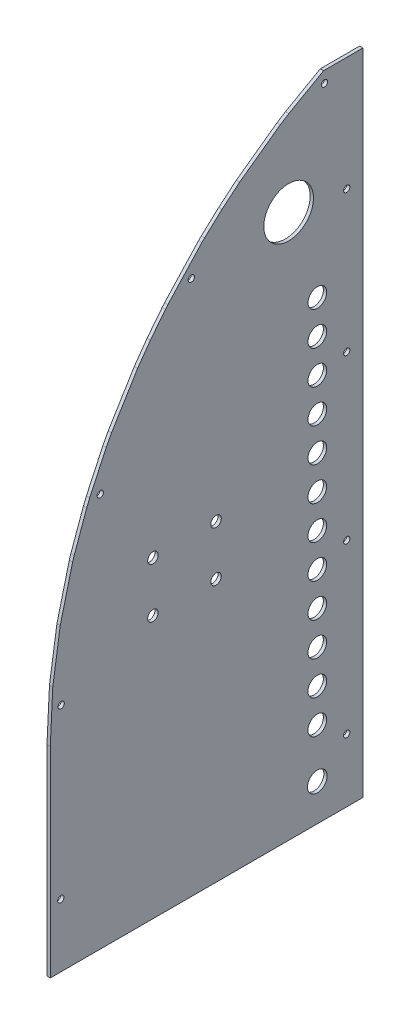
ISO-10303-21;
HEADER;
FILE_DESCRIPTION(('STEP AP214'),'2;1');
FILE_NAME('part.step','',(''),(''),'','','');
FILE_SCHEMA(('AUTOMOTIVE_DESIGN { 1 0 10303 214 1 1 1 1 }'));
ENDSEC;
DATA;
#1=APPLICATION_CONTEXT('core data for automotive mechanical design processes');
#2=APPLICATION_PROTOCOL_DEFINITION('international standard','automotive_design',2000,#1);
#3=PRODUCT_CONTEXT('',#1,'mechanical');
#4=PRODUCT('Part','Part','',(#3));
#5=PRODUCT_RELATED_PRODUCT_CATEGORY('part','',(#4));
#6=PRODUCT_DEFINITION_FORMATION('','',#4);
#7=PRODUCT_DEFINITION_CONTEXT('part definition',#1,'design');
#8=PRODUCT_DEFINITION('design','',#6,#7);
#9=PRODUCT_DEFINITION_SHAPE('','',#8);
#10=(LENGTH_UNIT() NAMED_UNIT(*) SI_UNIT(.MILLI.,.METRE.));
#11=(NAMED_UNIT(*) PLANE_ANGLE_UNIT() SI_UNIT($,.RADIAN.));
#12=(NAMED_UNIT(*) SI_UNIT($,.STERADIAN.) SOLID_ANGLE_UNIT());
#13=UNCERTAINTY_MEASURE_WITH_UNIT(LENGTH_MEASURE(1.E-05),#10,'distance_accuracy_value','');
#14=(GEOMETRIC_REPRESENTATION_CONTEXT(3) GLOBAL_UNCERTAINTY_ASSIGNED_CONTEXT((#13)) GLOBAL_UNIT_ASSIGNED_CONTEXT((#10,
#11,#12)) REPRESENTATION_CONTEXT('',''));
#15=CARTESIAN_POINT('',(0.,0.,0.));
#16=DIRECTION('',(0.,0.,1.));
#17=DIRECTION('',(1.,0.,0.));
#18=AXIS2_PLACEMENT_3D('',#15,#16,#17);
#19=CARTESIAN_POINT('',(909.536268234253,0.,956.76463842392));
#20=DIRECTION('',(0.,0.,-1.));
#21=DIRECTION('',(-1.,0.,0.));
#22=AXIS2_PLACEMENT_3D('',#19,#20,#21);
#23=PLANE('',#22);
#24=DIRECTION('',(0.,-1.,0.));
#25=VECTOR('',#24,1.);
#26=CARTESIAN_POINT('',(907.536268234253,0.,956.76463842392));
#27=LINE('',#26,#25);
#28=CARTESIAN_POINT('',(907.536268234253,777.58264541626,956.76463842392));
#29=VERTEX_POINT('',#28);
#30=CARTESIAN_POINT('',(907.536268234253,656.433909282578,956.76463842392));
#31=VERTEX_POINT('',#30);
#32=EDGE_CURVE('E307',#29,#31,#27,.T.);
#33=ORIENTED_EDGE('',*,*,#32,.T.);
#34=DIRECTION('',(-1.,0.,0.));
#35=VECTOR('',#34,1.);
#36=CARTESIAN_POINT('',(909.536268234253,656.433909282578,956.76463842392));
#37=LINE('',#36,#35);
#38=CARTESIAN_POINT('',(909.536268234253,656.433909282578,956.76463842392));
#39=VERTEX_POINT('',#38);
#40=EDGE_CURVE('E11',#39,#31,#37,.T.);
#41=ORIENTED_EDGE('',*,*,#40,.F.);
#42=DIRECTION('',(0.,-1.,0.));
#43=VECTOR('',#42,1.);
#44=CARTESIAN_POINT('',(909.536268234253,0.,956.76463842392));
#45=LINE('',#44,#43);
#46=CARTESIAN_POINT('',(909.536268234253,777.58264541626,956.76463842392));
#47=VERTEX_POINT('',#46);
#48=EDGE_CURVE('E473',#47,#39,#45,.T.);
#49=ORIENTED_EDGE('',*,*,#48,.F.);
#50=DIRECTION('',(-1.,0.,0.));
#51=VECTOR('',#50,1.);
#52=CARTESIAN_POINT('',(909.536268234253,777.58264541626,956.76463842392));
#53=LINE('',#52,#51);
#54=EDGE_CURVE('E222',#47,#29,#53,.T.);
#55=ORIENTED_EDGE('',*,*,#54,.T.);
#56=EDGE_LOOP('',(#33,#41,#49,#55));
#57=FACE_BOUND('',#56,.T.);
#58=ADVANCED_FACE('F39',(#57),#23,.F.);
#59=CARTESIAN_POINT('',(909.536268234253,656.433909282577,-3.82565977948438E-13));
#60=DIRECTION('',(0.,1.,0.));
#61=DIRECTION('',(0.,0.,1.));
#62=AXIS2_PLACEMENT_3D('',#59,#60,#61);
#63=PLANE('',#62);
#64=DIRECTION('',(0.,0.,-1.));
#65=VECTOR('',#64,1.);
#66=CARTESIAN_POINT('',(907.536268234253,656.433909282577,-3.82565977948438E-13));
#67=LINE('',#66,#65);
#68=CARTESIAN_POINT('',(907.536268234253,656.433909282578,767.871201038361));
#69=VERTEX_POINT('',#68);
#70=EDGE_CURVE('E310',#31,#69,#67,.T.);
#71=ORIENTED_EDGE('',*,*,#70,.T.);
#72=DIRECTION('',(-1.,0.,0.));
#73=VECTOR('',#72,1.);
#74=CARTESIAN_POINT('',(909.536268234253,656.433909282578,767.871201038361));
#75=LINE('',#74,#73);
#76=CARTESIAN_POINT('',(909.536268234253,656.433909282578,767.871201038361));
#77=VERTEX_POINT('',#76);
#78=EDGE_CURVE('E48',#77,#69,#75,.T.);
#79=ORIENTED_EDGE('',*,*,#78,.F.);
#80=DIRECTION('',(0.,0.,-1.));
#81=VECTOR('',#80,1.);
#82=CARTESIAN_POINT('',(909.536268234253,656.433909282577,-3.82565977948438E-13));
#83=LINE('',#82,#81);
#84=EDGE_CURVE('E144',#39,#77,#83,.T.);
#85=ORIENTED_EDGE('',*,*,#84,.F.);
#86=ORIENTED_EDGE('',*,*,#40,.T.);
#87=EDGE_LOOP('',(#71,#79,#85,#86));
#88=FACE_BOUND('',#87,.T.);
#89=ADVANCED_FACE('F488',(#88),#63,.F.);
#90=CARTESIAN_POINT('',(909.536268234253,0.,767.871201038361));
#91=DIRECTION('',(0.,0.,1.));
#92=DIRECTION('',(1.,0.,0.));
#93=AXIS2_PLACEMENT_3D('',#90,#91,#92);
#94=PLANE('',#93);
#95=DIRECTION('',(0.,1.,0.));
#96=VECTOR('',#95,1.);
#97=CARTESIAN_POINT('',(907.536268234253,0.,767.871201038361));
#98=LINE('',#97,#96);
#99=CARTESIAN_POINT('',(907.536268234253,1048.48289489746,767.871201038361));
#100=VERTEX_POINT('',#99);
#101=EDGE_CURVE('E312',#69,#100,#98,.T.);
#102=ORIENTED_EDGE('',*,*,#101,.T.);
#103=DIRECTION('',(-1.,0.,0.));
#104=VECTOR('',#103,1.);
#105=CARTESIAN_POINT('',(909.536268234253,1048.48289489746,767.871201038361));
#106=LINE('',#105,#104);
#107=CARTESIAN_POINT('',(909.536268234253,1048.48289489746,767.871201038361));
#108=VERTEX_POINT('',#107);
#109=EDGE_CURVE('E403',#108,#100,#106,.T.);
#110=ORIENTED_EDGE('',*,*,#109,.F.);
#111=DIRECTION('',(0.,1.,0.));
#112=VECTOR('',#111,1.);
#113=CARTESIAN_POINT('',(909.536268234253,0.,767.871201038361));
#114=LINE('',#113,#112);
#115=EDGE_CURVE('E411',#77,#108,#114,.T.);
#116=ORIENTED_EDGE('',*,*,#115,.F.);
#117=ORIENTED_EDGE('',*,*,#78,.T.);
#118=EDGE_LOOP('',(#102,#110,#116,#117));
#119=FACE_BOUND('',#118,.T.);
#120=ADVANCED_FACE('F409',(#119),#94,.F.);
#121=CARTESIAN_POINT('',(909.536268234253,1048.48289489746,0.));
#122=DIRECTION('',(0.,-1.,0.));
#123=DIRECTION('',(0.,0.,-1.));
#124=AXIS2_PLACEMENT_3D('',#121,#122,#123);
#125=PLANE('',#124);
#126=DIRECTION('',(0.,0.,1.));
#127=VECTOR('',#126,1.);
#128=CARTESIAN_POINT('',(907.536268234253,1048.48289489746,0.));
#129=LINE('',#128,#127);
#130=CARTESIAN_POINT('',(907.536268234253,1048.48289489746,791.664659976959));
#131=VERTEX_POINT('',#130);
#132=EDGE_CURVE('E314',#100,#131,#129,.T.);
#133=ORIENTED_EDGE('',*,*,#132,.T.);
#134=DIRECTION('',(-1.,0.,0.));
#135=VECTOR('',#134,1.);
#136=CARTESIAN_POINT('',(909.536268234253,1048.48289489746,791.664659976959));
#137=LINE('',#136,#135);
#138=CARTESIAN_POINT('',(909.536268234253,1048.48289489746,791.664659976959));
#139=VERTEX_POINT('',#138);
#140=EDGE_CURVE('E400',#139,#131,#137,.T.);
#141=ORIENTED_EDGE('',*,*,#140,.F.);
#142=DIRECTION('',(0.,0.,1.));
#143=VECTOR('',#142,1.);
#144=CARTESIAN_POINT('',(909.536268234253,1048.48289489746,0.));
#145=LINE('',#144,#143);
#146=EDGE_CURVE('E429',#108,#139,#145,.T.);
#147=ORIENTED_EDGE('',*,*,#146,.F.);
#148=ORIENTED_EDGE('',*,*,#109,.T.);
#149=EDGE_LOOP('',(#133,#141,#147,#148));
#150=FACE_BOUND('',#149,.T.);
#151=ADVANCED_FACE('F420',(#150),#125,.F.);
#152=CARTESIAN_POINT('',(909.536268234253,1133.09131847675,642.437608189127));
#153=DIRECTION('',(0.,-0.869906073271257,-0.493217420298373));
#154=DIRECTION('',(0.,0.493217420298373,-0.869906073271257));
#155=AXIS2_PLACEMENT_3D('',#152,#153,#154);
#156=PLANE('',#155);
#157=DIRECTION('',(0.,-0.493217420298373,0.869906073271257));
#158=VECTOR('',#157,1.);
#159=CARTESIAN_POINT('',(907.536268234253,1133.09131847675,642.437608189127));
#160=LINE('',#159,#158);
#161=CARTESIAN_POINT('',(907.536268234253,1036.55982017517,812.69383430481));
#162=VERTEX_POINT('',#161);
#163=EDGE_CURVE('E316',#131,#162,#160,.T.);
#164=ORIENTED_EDGE('',*,*,#163,.T.);
#165=DIRECTION('',(-1.,0.,0.));
#166=VECTOR('',#165,1.);
#167=CARTESIAN_POINT('',(909.536268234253,1036.55982017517,812.69383430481));
#168=LINE('',#167,#166);
#169=CARTESIAN_POINT('',(909.536268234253,1036.55982017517,812.69383430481));
#170=VERTEX_POINT('',#169);
#171=EDGE_CURVE('E397',#170,#162,#168,.T.);
#172=ORIENTED_EDGE('',*,*,#171,.F.);
#173=DIRECTION('',(0.,-0.493217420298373,0.869906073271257));
#174=VECTOR('',#173,1.);
#175=CARTESIAN_POINT('',(909.536268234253,1133.09131847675,642.437608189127));
#176=LINE('',#175,#174);
#177=EDGE_CURVE('E426',#139,#170,#176,.T.);
#178=ORIENTED_EDGE('',*,*,#177,.F.);
#179=ORIENTED_EDGE('',*,*,#140,.T.);
#180=EDGE_LOOP('',(#164,#172,#178,#179));
#181=FACE_BOUND('',#180,.T.);
#182=ADVANCED_FACE('F424',(#181),#156,.F.);
#183=CARTESIAN_POINT('',(909.536268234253,1106.59075538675,702.357443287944));
#184=DIRECTION('',(0.,-0.844295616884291,-0.535877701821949));
#185=DIRECTION('',(0.,0.535877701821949,-0.844295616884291));
#186=AXIS2_PLACEMENT_3D('',#183,#184,#185);
#187=PLANE('',#186);
#188=DIRECTION('',(0.,-0.53587770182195,0.844295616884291));
#189=VECTOR('',#188,1.);
#190=CARTESIAN_POINT('',(907.536268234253,1106.59075538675,702.357443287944));
#191=LINE('',#190,#189);
#192=CARTESIAN_POINT('',(907.536268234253,1033.26308727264,817.887961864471));
#193=VERTEX_POINT('',#192);
#194=EDGE_CURVE('E318',#162,#193,#191,.T.);
#195=ORIENTED_EDGE('',*,*,#194,.T.);
#196=DIRECTION('',(-1.,0.,0.));
#197=VECTOR('',#196,1.);
#198=CARTESIAN_POINT('',(909.536268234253,1033.26308727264,817.887961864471));
#199=LINE('',#198,#197);
#200=CARTESIAN_POINT('',(909.536268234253,1033.26308727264,817.887961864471));
#201=VERTEX_POINT('',#200);
#202=EDGE_CURVE('E394',#201,#193,#199,.T.);
#203=ORIENTED_EDGE('',*,*,#202,.F.);
#204=DIRECTION('',(0.,-0.53587770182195,0.844295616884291));
#205=VECTOR('',#204,1.);
#206=CARTESIAN_POINT('',(909.536268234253,1106.59075538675,702.357443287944));
#207=LINE('',#206,#205);
#208=EDGE_CURVE('E428',#170,#201,#207,.T.);
#209=ORIENTED_EDGE('',*,*,#208,.F.);
#210=ORIENTED_EDGE('',*,*,#171,.T.);
#211=EDGE_LOOP('',(#195,#203,#209,#210));
#212=FACE_BOUND('',#211,.T.);
#213=ADVANCED_FACE('F996',(#212),#187,.F.);
#214=CARTESIAN_POINT('',(909.536268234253,1067.3341058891,770.703596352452));
#215=DIRECTION('',(0.,-0.81073287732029,-0.585416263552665));
#216=DIRECTION('',(0.,0.585416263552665,-0.81073287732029));
#217=AXIS2_PLACEMENT_3D('',#214,#215,#216);
#218=PLANE('',#217);
#219=DIRECTION('',(0.,-0.585416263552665,0.81073287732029));
#220=VECTOR('',#219,1.);
#221=CARTESIAN_POINT('',(907.536268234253,1067.3341058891,770.703596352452));
#222=LINE('',#221,#220);
#223=CARTESIAN_POINT('',(907.536268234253,1015.51330089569,842.469334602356));
#224=VERTEX_POINT('',#223);
#225=EDGE_CURVE('E320',#193,#224,#222,.T.);
#226=ORIENTED_EDGE('',*,*,#225,.T.);
#227=DIRECTION('',(-1.,0.,0.));
#228=VECTOR('',#227,1.);
#229=CARTESIAN_POINT('',(909.536268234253,1015.51330089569,842.469334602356));
#230=LINE('',#229,#228);
#231=CARTESIAN_POINT('',(909.536268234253,1015.51330089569,842.469334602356));
#232=VERTEX_POINT('',#231);
#233=EDGE_CURVE('E391',#232,#224,#230,.T.);
#234=ORIENTED_EDGE('',*,*,#233,.F.);
#235=DIRECTION('',(0.,-0.585416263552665,0.81073287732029));
#236=VECTOR('',#235,1.);
#237=CARTESIAN_POINT('',(909.536268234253,1067.3341058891,770.703596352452));
#238=LINE('',#237,#236);
#239=EDGE_CURVE('E431',#201,#232,#238,.T.);
#240=ORIENTED_EDGE('',*,*,#239,.F.);
#241=ORIENTED_EDGE('',*,*,#202,.T.);
#242=EDGE_LOOP('',(#226,#234,#240,#241));
#243=FACE_BOUND('',#242,.T.);
#244=ADVANCED_FACE('F987',(#243),#218,.F.);
#245=CARTESIAN_POINT('',(909.536268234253,1011.08902005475,847.746081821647));
#246=DIRECTION('',(0.,-0.766290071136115,-0.642494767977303));
#247=DIRECTION('',(0.,0.642494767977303,-0.766290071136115));
#248=AXIS2_PLACEMENT_3D('',#245,#246,#247);
#249=PLANE('',#248);
#250=DIRECTION('',(0.,-0.642494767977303,0.766290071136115));
#251=VECTOR('',#250,1.);
#252=CARTESIAN_POINT('',(907.536268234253,1011.08902005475,847.746081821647));
#253=LINE('',#252,#251);
#254=CARTESIAN_POINT('',(907.536268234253,1006.66165351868,853.026509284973));
#255=VERTEX_POINT('',#254);
#256=EDGE_CURVE('E322',#224,#255,#253,.T.);
#257=ORIENTED_EDGE('',*,*,#256,.T.);
#258=DIRECTION('',(-1.,0.,0.));
#259=VECTOR('',#258,1.);
#260=CARTESIAN_POINT('',(909.536268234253,1006.66165351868,853.026509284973));
#261=LINE('',#260,#259);
#262=CARTESIAN_POINT('',(909.536268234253,1006.66165351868,853.026509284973));
#263=VERTEX_POINT('',#262);
#264=EDGE_CURVE('E388',#263,#255,#261,.T.);
#265=ORIENTED_EDGE('',*,*,#264,.F.);
#266=DIRECTION('',(0.,-0.642494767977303,0.766290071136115));
#267=VECTOR('',#266,1.);
#268=CARTESIAN_POINT('',(909.536268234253,1011.08902005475,847.746081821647));
#269=LINE('',#268,#267);
#270=EDGE_CURVE('E437',#232,#263,#269,.T.);
#271=ORIENTED_EDGE('',*,*,#270,.F.);
#272=ORIENTED_EDGE('',*,*,#233,.T.);
#273=EDGE_LOOP('',(#257,#265,#271,#272));
#274=FACE_BOUND('',#273,.T.);
#275=ADVANCED_FACE('F978',(#274),#249,.F.);
#276=CARTESIAN_POINT('',(909.536268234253,970.164994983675,892.690621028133));
#277=DIRECTION('',(0.,-0.735878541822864,-0.677113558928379));
#278=DIRECTION('',(0.,0.677113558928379,-0.735878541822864));
#279=AXIS2_PLACEMENT_3D('',#276,#277,#278);
#280=PLANE('',#279);
#281=DIRECTION('',(0.,-0.677113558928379,0.735878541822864));
#282=VECTOR('',#281,1.);
#283=CARTESIAN_POINT('',(907.536268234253,970.164994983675,892.690621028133));
#284=LINE('',#283,#282);
#285=CARTESIAN_POINT('',(907.536268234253,996.972441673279,863.556623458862));
#286=VERTEX_POINT('',#285);
#287=EDGE_CURVE('E324',#255,#286,#284,.T.);
#288=ORIENTED_EDGE('',*,*,#287,.T.);
#289=DIRECTION('',(-1.,0.,0.));
#290=VECTOR('',#289,1.);
#291=CARTESIAN_POINT('',(909.536268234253,996.972441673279,863.556623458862));
#292=LINE('',#291,#290);
#293=CARTESIAN_POINT('',(909.536268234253,996.972441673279,863.556623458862));
#294=VERTEX_POINT('',#293);
#295=EDGE_CURVE('E385',#294,#286,#292,.T.);
#296=ORIENTED_EDGE('',*,*,#295,.F.);
#297=DIRECTION('',(0.,-0.677113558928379,0.735878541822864));
#298=VECTOR('',#297,1.);
#299=CARTESIAN_POINT('',(909.536268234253,970.164994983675,892.690621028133));
#300=LINE('',#299,#298);
#301=EDGE_CURVE('E439',#263,#294,#300,.T.);
#302=ORIENTED_EDGE('',*,*,#301,.F.);
#303=ORIENTED_EDGE('',*,*,#264,.T.);
#304=EDGE_LOOP('',(#288,#296,#302,#303));
#305=FACE_BOUND('',#304,.T.);
#306=ADVANCED_FACE('F969',(#305),#280,.F.);
#307=CARTESIAN_POINT('',(909.536268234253,944.467665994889,917.598827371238));
#308=DIRECTION('',(0.,-0.717235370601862,-0.696830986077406));
#309=DIRECTION('',(0.,0.696830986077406,-0.717235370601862));
#310=AXIS2_PLACEMENT_3D('',#307,#308,#309);
#311=PLANE('',#310);
#312=DIRECTION('',(0.,-0.696830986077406,0.717235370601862));
#313=VECTOR('',#312,1.);
#314=CARTESIAN_POINT('',(907.536268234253,944.467665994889,917.598827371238));
#315=LINE('',#314,#313);
#316=CARTESIAN_POINT('',(907.536268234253,995.40913105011,865.165710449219));
#317=VERTEX_POINT('',#316);
#318=EDGE_CURVE('E326',#286,#317,#315,.T.);
#319=ORIENTED_EDGE('',*,*,#318,.T.);
#320=DIRECTION('',(-1.,0.,0.));
#321=VECTOR('',#320,1.);
#322=CARTESIAN_POINT('',(909.536268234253,995.40913105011,865.165710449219));
#323=LINE('',#322,#321);
#324=CARTESIAN_POINT('',(909.536268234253,995.40913105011,865.165710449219));
#325=VERTEX_POINT('',#324);
#326=EDGE_CURVE('E382',#325,#317,#323,.T.);
#327=ORIENTED_EDGE('',*,*,#326,.F.);
#328=DIRECTION('',(0.,-0.696830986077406,0.717235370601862));
#329=VECTOR('',#328,1.);
#330=CARTESIAN_POINT('',(909.536268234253,944.467665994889,917.598827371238));
#331=LINE('',#330,#329);
#332=EDGE_CURVE('E441',#294,#325,#331,.T.);
#333=ORIENTED_EDGE('',*,*,#332,.F.);
#334=ORIENTED_EDGE('',*,*,#295,.T.);
#335=EDGE_LOOP('',(#319,#327,#333,#334));
#336=FACE_BOUND('',#335,.T.);
#337=ADVANCED_FACE('F960',(#336),#311,.F.);
#338=CARTESIAN_POINT('',(909.536268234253,890.161156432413,962.503212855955));
#339=DIRECTION('',(0.,-0.678978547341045,-0.734158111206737));
#340=DIRECTION('',(0.,0.734158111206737,-0.678978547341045));
#341=AXIS2_PLACEMENT_3D('',#338,#339,#340);
#342=PLANE('',#341);
#343=DIRECTION('',(0.,-0.734158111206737,0.678978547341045));
#344=VECTOR('',#343,1.);
#345=CARTESIAN_POINT('',(907.536268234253,890.161156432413,962.503212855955));
#346=LINE('',#345,#344);
#347=CARTESIAN_POINT('',(907.536268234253,973.149478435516,885.752320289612));
#348=VERTEX_POINT('',#347);
#349=EDGE_CURVE('E328',#317,#348,#346,.T.);
#350=ORIENTED_EDGE('',*,*,#349,.T.);
#351=DIRECTION('',(-1.,0.,0.));
#352=VECTOR('',#351,1.);
#353=CARTESIAN_POINT('',(909.536268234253,973.149478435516,885.752320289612));
#354=LINE('',#353,#352);
#355=CARTESIAN_POINT('',(909.536268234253,973.149478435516,885.752320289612));
#356=VERTEX_POINT('',#355);
#357=EDGE_CURVE('E379',#356,#348,#354,.T.);
#358=ORIENTED_EDGE('',*,*,#357,.F.);
#359=DIRECTION('',(0.,-0.734158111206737,0.678978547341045));
#360=VECTOR('',#359,1.);
#361=CARTESIAN_POINT('',(909.536268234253,890.161156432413,962.503212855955));
#362=LINE('',#361,#360);
#363=EDGE_CURVE('E443',#325,#356,#362,.T.);
#364=ORIENTED_EDGE('',*,*,#363,.F.);
#365=ORIENTED_EDGE('',*,*,#326,.T.);
#366=EDGE_LOOP('',(#350,#358,#364,#365));
#367=FACE_BOUND('',#366,.T.);
#368=ADVANCED_FACE('F951',(#367),#342,.F.);
#369=CARTESIAN_POINT('',(909.536268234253,832.317463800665,1002.65847360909));
#370=DIRECTION('',(0.,-0.638719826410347,-0.769439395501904));
#371=DIRECTION('',(0.,0.769439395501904,-0.638719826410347));
#372=AXIS2_PLACEMENT_3D('',#369,#370,#371);
#373=PLANE('',#372);
#374=DIRECTION('',(0.,-0.769439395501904,0.638719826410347));
#375=VECTOR('',#374,1.);
#376=CARTESIAN_POINT('',(907.536268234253,832.317463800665,1002.65847360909));
#377=LINE('',#376,#375);
#378=CARTESIAN_POINT('',(907.536268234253,971.377015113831,887.223660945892));
#379=VERTEX_POINT('',#378);
#380=EDGE_CURVE('E330',#348,#379,#377,.T.);
#381=ORIENTED_EDGE('',*,*,#380,.T.);
#382=DIRECTION('',(-1.,0.,0.));
#383=VECTOR('',#382,1.);
#384=CARTESIAN_POINT('',(909.536268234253,971.377015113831,887.223660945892));
#385=LINE('',#384,#383);
#386=CARTESIAN_POINT('',(909.536268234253,971.377015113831,887.223660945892));
#387=VERTEX_POINT('',#386);
#388=EDGE_CURVE('E376',#387,#379,#385,.T.);
#389=ORIENTED_EDGE('',*,*,#388,.F.);
#390=DIRECTION('',(0.,-0.769439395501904,0.638719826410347));
#391=VECTOR('',#390,1.);
#392=CARTESIAN_POINT('',(909.536268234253,832.317463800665,1002.65847360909));
#393=LINE('',#392,#391);
#394=EDGE_CURVE('E445',#356,#387,#393,.T.);
#395=ORIENTED_EDGE('',*,*,#394,.F.);
#396=ORIENTED_EDGE('',*,*,#357,.T.);
#397=EDGE_LOOP('',(#381,#389,#395,#396));
#398=FACE_BOUND('',#397,.T.);
#399=ADVANCED_FACE('F942',(#398),#373,.F.);
#400=CARTESIAN_POINT('',(909.536268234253,800.552313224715,1021.14586963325));
#401=DIRECTION('',(0.,-0.616974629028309,-0.786983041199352));
#402=DIRECTION('',(0.,0.786983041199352,-0.616974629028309));
#403=AXIS2_PLACEMENT_3D('',#400,#401,#402);
#404=PLANE('',#403);
#405=DIRECTION('',(0.,-0.786983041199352,0.616974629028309));
#406=VECTOR('',#405,1.);
#407=CARTESIAN_POINT('',(907.536268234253,800.552313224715,1021.14586963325));
#408=LINE('',#407,#406);
#409=CARTESIAN_POINT('',(907.536268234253,959.787487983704,896.309554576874));
#410=VERTEX_POINT('',#409);
#411=EDGE_CURVE('E332',#379,#410,#408,.T.);
#412=ORIENTED_EDGE('',*,*,#411,.T.);
#413=DIRECTION('',(-1.,0.,0.));
#414=VECTOR('',#413,1.);
#415=CARTESIAN_POINT('',(909.536268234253,959.787487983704,896.309554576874));
#416=LINE('',#415,#414);
#417=CARTESIAN_POINT('',(909.536268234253,959.787487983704,896.309554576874));
#418=VERTEX_POINT('',#417);
#419=EDGE_CURVE('E373',#418,#410,#416,.T.);
#420=ORIENTED_EDGE('',*,*,#419,.F.);
#421=DIRECTION('',(0.,-0.786983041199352,0.616974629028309));
#422=VECTOR('',#421,1.);
#423=CARTESIAN_POINT('',(909.536268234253,800.552313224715,1021.14586963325));
#424=LINE('',#423,#422);
#425=EDGE_CURVE('E447',#387,#418,#424,.T.);
#426=ORIENTED_EDGE('',*,*,#425,.F.);
#427=ORIENTED_EDGE('',*,*,#388,.T.);
#428=EDGE_LOOP('',(#412,#420,#426,#427));
#429=FACE_BOUND('',#428,.T.);
#430=ADVANCED_FACE('F933',(#429),#404,.F.);
#431=CARTESIAN_POINT('',(909.536268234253,746.583834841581,1048.16903159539));
#432=DIRECTION('',(0.,-0.580152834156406,-0.814507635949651));
#433=DIRECTION('',(0.,0.814507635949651,-0.580152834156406));
#434=AXIS2_PLACEMENT_3D('',#431,#432,#433);
#435=PLANE('',#434);
#436=DIRECTION('',(0.,-0.814507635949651,0.580152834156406));
#437=VECTOR('',#436,1.);
#438=CARTESIAN_POINT('',(907.536268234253,746.583834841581,1048.16903159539));
#439=LINE('',#438,#437);
#440=CARTESIAN_POINT('',(907.536268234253,948.954582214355,904.025554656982));
#441=VERTEX_POINT('',#440);
#442=EDGE_CURVE('E334',#410,#441,#439,.T.);
#443=ORIENTED_EDGE('',*,*,#442,.T.);
#444=DIRECTION('',(-1.,0.,0.));
#445=VECTOR('',#444,1.);
#446=CARTESIAN_POINT('',(909.536268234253,948.954582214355,904.025554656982));
#447=LINE('',#446,#445);
#448=CARTESIAN_POINT('',(909.536268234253,948.954582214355,904.025554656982));
#449=VERTEX_POINT('',#448);
#450=EDGE_CURVE('E370',#449,#441,#447,.T.);
#451=ORIENTED_EDGE('',*,*,#450,.F.);
#452=DIRECTION('',(0.,-0.814507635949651,0.580152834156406));
#453=VECTOR('',#452,1.);
#454=CARTESIAN_POINT('',(909.536268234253,746.583834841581,1048.16903159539));
#455=LINE('',#454,#453);
#456=EDGE_CURVE('E449',#418,#449,#455,.T.);
#457=ORIENTED_EDGE('',*,*,#456,.F.);
#458=ORIENTED_EDGE('',*,*,#419,.T.);
#459=EDGE_LOOP('',(#443,#451,#457,#458));
#460=FACE_BOUND('',#459,.T.);
#461=ADVANCED_FACE('F924',(#460),#435,.F.);
#462=CARTESIAN_POINT('',(909.536268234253,658.749136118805,1080.89125349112));
#463=DIRECTION('',(0.,-0.52041685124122,-0.853912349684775));
#464=DIRECTION('',(0.,0.853912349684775,-0.52041685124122));
#465=AXIS2_PLACEMENT_3D('',#462,#463,#464);
#466=PLANE('',#465);
#467=DIRECTION('',(0.,-0.853912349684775,0.52041685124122));
#468=VECTOR('',#467,1.);
#469=CARTESIAN_POINT('',(907.536268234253,658.749136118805,1080.89125349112));
#470=LINE('',#469,#468);
#471=CARTESIAN_POINT('',(907.536268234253,923.063993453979,919.804573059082));
#472=VERTEX_POINT('',#471);
#473=EDGE_CURVE('E336',#441,#472,#470,.T.);
#474=ORIENTED_EDGE('',*,*,#473,.T.);
#475=DIRECTION('',(-1.,0.,0.));
#476=VECTOR('',#475,1.);
#477=CARTESIAN_POINT('',(909.536268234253,923.063993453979,919.804573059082));
#478=LINE('',#477,#476);
#479=CARTESIAN_POINT('',(909.536268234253,923.063993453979,919.804573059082));
#480=VERTEX_POINT('',#479);
#481=EDGE_CURVE('E367',#480,#472,#478,.T.);
#482=ORIENTED_EDGE('',*,*,#481,.F.);
#483=DIRECTION('',(0.,-0.853912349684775,0.52041685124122));
#484=VECTOR('',#483,1.);
#485=CARTESIAN_POINT('',(909.536268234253,658.749136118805,1080.89125349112));
#486=LINE('',#485,#484);
#487=EDGE_CURVE('E451',#449,#480,#486,.T.);
#488=ORIENTED_EDGE('',*,*,#487,.F.);
#489=ORIENTED_EDGE('',*,*,#450,.T.);
#490=EDGE_LOOP('',(#474,#482,#488,#489));
#491=FACE_BOUND('',#490,.T.);
#492=ADVANCED_FACE('F915',(#491),#466,.F.);
#493=CARTESIAN_POINT('',(909.536268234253,581.806234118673,1100.25844131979));
#494=DIRECTION('',(0.,-0.467458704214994,-0.884014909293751));
#495=DIRECTION('',(0.,0.884014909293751,-0.467458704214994));
#496=AXIS2_PLACEMENT_3D('',#493,#494,#495);
#497=PLANE('',#496);
#498=DIRECTION('',(0.,-0.884014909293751,0.467458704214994));
#499=VECTOR('',#498,1.);
#500=CARTESIAN_POINT('',(907.536268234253,581.806234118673,1100.25844131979));
#501=LINE('',#500,#499);
#502=CARTESIAN_POINT('',(907.536268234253,917.047739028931,922.985911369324));
#503=VERTEX_POINT('',#502);
#504=EDGE_CURVE('E338',#472,#503,#501,.T.);
#505=ORIENTED_EDGE('',*,*,#504,.T.);
#506=DIRECTION('',(-1.,0.,0.));
#507=VECTOR('',#506,1.);
#508=CARTESIAN_POINT('',(909.536268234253,917.047739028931,922.985911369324));
#509=LINE('',#508,#507);
#510=CARTESIAN_POINT('',(909.536268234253,917.047739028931,922.985911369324));
#511=VERTEX_POINT('',#510);
#512=EDGE_CURVE('E364',#511,#503,#509,.T.);
#513=ORIENTED_EDGE('',*,*,#512,.F.);
#514=DIRECTION('',(0.,-0.884014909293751,0.467458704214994));
#515=VECTOR('',#514,1.);
#516=CARTESIAN_POINT('',(909.536268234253,581.806234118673,1100.25844131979));
#517=LINE('',#516,#515);
#518=EDGE_CURVE('E453',#480,#511,#517,.T.);
#519=ORIENTED_EDGE('',*,*,#518,.F.);
#520=ORIENTED_EDGE('',*,*,#481,.T.);
#521=EDGE_LOOP('',(#505,#513,#519,#520));
#522=FACE_BOUND('',#521,.T.);
#523=ADVANCED_FACE('F906',(#522),#497,.F.);
#524=CARTESIAN_POINT('',(909.536268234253,517.735646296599,1109.34622036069));
#525=DIRECTION('',(0.,-0.422912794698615,-0.906170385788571));
#526=DIRECTION('',(0.,0.906170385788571,-0.422912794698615));
#527=AXIS2_PLACEMENT_3D('',#524,#525,#526);
#528=PLANE('',#527);
#529=DIRECTION('',(0.,-0.906170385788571,0.422912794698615));
#530=VECTOR('',#529,1.);
#531=CARTESIAN_POINT('',(907.536268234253,517.735646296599,1109.34622036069));
#532=LINE('',#531,#530);
#533=CARTESIAN_POINT('',(907.536268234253,895.733773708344,932.933211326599));
#534=VERTEX_POINT('',#533);
#535=EDGE_CURVE('E340',#503,#534,#532,.T.);
#536=ORIENTED_EDGE('',*,*,#535,.T.);
#537=DIRECTION('',(-1.,0.,0.));
#538=VECTOR('',#537,1.);
#539=CARTESIAN_POINT('',(909.536268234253,895.733773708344,932.933211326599));
#540=LINE('',#539,#538);
#541=CARTESIAN_POINT('',(909.536268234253,895.733773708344,932.933211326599));
#542=VERTEX_POINT('',#541);
#543=EDGE_CURVE('E361',#542,#534,#540,.T.);
#544=ORIENTED_EDGE('',*,*,#543,.F.);
#545=DIRECTION('',(0.,-0.906170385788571,0.422912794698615));
#546=VECTOR('',#545,1.);
#547=CARTESIAN_POINT('',(909.536268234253,517.735646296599,1109.34622036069));
#548=LINE('',#547,#546);
#549=EDGE_CURVE('E455',#511,#542,#548,.T.);
#550=ORIENTED_EDGE('',*,*,#549,.F.);
#551=ORIENTED_EDGE('',*,*,#512,.T.);
#552=EDGE_LOOP('',(#536,#544,#550,#551));
#553=FACE_BOUND('',#552,.T.);
#554=ADVANCED_FACE('F897',(#553),#528,.F.);
#555=CARTESIAN_POINT('',(909.536268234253,458.040242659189,1113.05174728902));
#556=DIRECTION('',(0.,-0.380554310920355,-0.924758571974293));
#557=DIRECTION('',(0.,0.924758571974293,-0.380554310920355));
#558=AXIS2_PLACEMENT_3D('',#555,#556,#557);
#559=PLANE('',#558);
#560=DIRECTION('',(0.,-0.924758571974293,0.380554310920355));
#561=VECTOR('',#560,1.);
#562=CARTESIAN_POINT('',(907.536268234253,458.040242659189,1113.05174728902));
#563=LINE('',#562,#561);
#564=CARTESIAN_POINT('',(907.536268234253,891.408383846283,934.713184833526));
#565=VERTEX_POINT('',#564);
#566=EDGE_CURVE('E342',#534,#565,#563,.T.);
#567=ORIENTED_EDGE('',*,*,#566,.T.);
#568=DIRECTION('',(-1.,0.,0.));
#569=VECTOR('',#568,1.);
#570=CARTESIAN_POINT('',(909.536268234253,891.408383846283,934.713184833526));
#571=LINE('',#570,#569);
#572=CARTESIAN_POINT('',(909.536268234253,891.408383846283,934.713184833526));
#573=VERTEX_POINT('',#572);
#574=EDGE_CURVE('E358',#573,#565,#571,.T.);
#575=ORIENTED_EDGE('',*,*,#574,.F.);
#576=DIRECTION('',(0.,-0.924758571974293,0.380554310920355));
#577=VECTOR('',#576,1.);
#578=CARTESIAN_POINT('',(909.536268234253,458.040242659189,1113.05174728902));
#579=LINE('',#578,#577);
#580=EDGE_CURVE('E457',#542,#573,#579,.T.);
#581=ORIENTED_EDGE('',*,*,#580,.F.);
#582=ORIENTED_EDGE('',*,*,#543,.T.);
#583=EDGE_LOOP('',(#567,#575,#581,#582));
#584=FACE_BOUND('',#583,.T.);
#585=ADVANCED_FACE('F889',(#584),#559,.F.);
#586=CARTESIAN_POINT('',(909.536268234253,400.586075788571,1111.59161689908));
#587=DIRECTION('',(0.,-0.339028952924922,-0.940775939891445));
#588=DIRECTION('',(0.,0.940775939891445,-0.339028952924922));
#589=AXIS2_PLACEMENT_3D('',#586,#587,#588);
#590=PLANE('',#589);
#591=DIRECTION('',(0.,-0.940775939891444,0.339028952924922));
#592=VECTOR('',#591,1.);
#593=CARTESIAN_POINT('',(907.536268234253,400.586075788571,1111.59161689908));
#594=LINE('',#593,#592);
#595=CARTESIAN_POINT('',(907.536268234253,870.288252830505,942.32428073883));
#596=VERTEX_POINT('',#595);
#597=EDGE_CURVE('E344',#565,#596,#594,.T.);
#598=ORIENTED_EDGE('',*,*,#597,.T.);
#599=DIRECTION('',(-1.,0.,0.));
#600=VECTOR('',#599,1.);
#601=CARTESIAN_POINT('',(909.536268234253,870.288252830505,942.32428073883));
#602=LINE('',#601,#600);
#603=CARTESIAN_POINT('',(909.536268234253,870.288252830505,942.32428073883));
#604=VERTEX_POINT('',#603);
#605=EDGE_CURVE('E355',#604,#596,#602,.T.);
#606=ORIENTED_EDGE('',*,*,#605,.F.);
#607=DIRECTION('',(0.,-0.940775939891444,0.339028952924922));
#608=VECTOR('',#607,1.);
#609=CARTESIAN_POINT('',(909.536268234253,400.586075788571,1111.59161689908));
#610=LINE('',#609,#608);
#611=EDGE_CURVE('E459',#573,#604,#610,.T.);
#612=ORIENTED_EDGE('',*,*,#611,.F.);
#613=ORIENTED_EDGE('',*,*,#574,.T.);
#614=EDGE_LOOP('',(#598,#606,#612,#613));
#615=FACE_BOUND('',#614,.T.);
#616=ADVANCED_FACE('F465',(#615),#590,.F.);
#617=CARTESIAN_POINT('',(909.536268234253,346.858261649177,1106.41782066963));
#618=DIRECTION('',(0.,-0.299141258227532,-0.954208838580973));
#619=DIRECTION('',(0.,0.954208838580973,-0.299141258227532));
#620=AXIS2_PLACEMENT_3D('',#617,#618,#619);
#621=PLANE('',#620);
#622=DIRECTION('',(0.,-0.954208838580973,0.299141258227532));
#623=VECTOR('',#622,1.);
#624=CARTESIAN_POINT('',(907.536268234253,346.858261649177,1106.41782066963));
#625=LINE('',#624,#623);
#626=CARTESIAN_POINT('',(907.536268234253,867.234408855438,943.281650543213));
#627=VERTEX_POINT('',#626);
#628=EDGE_CURVE('E346',#596,#627,#625,.T.);
#629=ORIENTED_EDGE('',*,*,#628,.T.);
#630=DIRECTION('',(-1.,0.,0.));
#631=VECTOR('',#630,1.);
#632=CARTESIAN_POINT('',(909.536268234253,867.234408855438,943.281650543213));
#633=LINE('',#632,#631);
#634=CARTESIAN_POINT('',(909.536268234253,867.234408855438,943.281650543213));
#635=VERTEX_POINT('',#634);
#636=EDGE_CURVE('E217',#635,#627,#633,.T.);
#637=ORIENTED_EDGE('',*,*,#636,.F.);
#638=DIRECTION('',(0.,-0.954208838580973,0.299141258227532));
#639=VECTOR('',#638,1.);
#640=CARTESIAN_POINT('',(909.536268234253,346.858261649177,1106.41782066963));
#641=LINE('',#640,#639);
#642=EDGE_CURVE('E208',#604,#635,#641,.T.);
#643=ORIENTED_EDGE('',*,*,#642,.F.);
#644=ORIENTED_EDGE('',*,*,#605,.T.);
#645=EDGE_LOOP('',(#629,#637,#643,#644));
#646=FACE_BOUND('',#645,.T.);
#647=ADVANCED_FACE('F469',(#646),#621,.F.);
#648=CARTESIAN_POINT('',(909.536268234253,277.696618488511,1093.05672377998));
#649=DIRECTION('',(0.,-0.246232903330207,-0.969210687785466));
#650=DIRECTION('',(0.,0.969210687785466,-0.246232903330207));
#651=AXIS2_PLACEMENT_3D('',#648,#649,#650);
#652=PLANE('',#651);
#653=DIRECTION('',(0.,-0.969210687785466,0.246232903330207));
#654=VECTOR('',#653,1.);
#655=CARTESIAN_POINT('',(907.536268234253,277.696618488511,1093.05672377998));
#656=LINE('',#655,#654);
#657=CARTESIAN_POINT('',(907.536268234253,837.847948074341,950.747430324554));
#658=VERTEX_POINT('',#657);
#659=EDGE_CURVE('E216',#627,#658,#656,.T.);
#660=ORIENTED_EDGE('',*,*,#659,.T.);
#661=DIRECTION('',(-1.,0.,0.));
#662=VECTOR('',#661,1.);
#663=CARTESIAN_POINT('',(909.536268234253,837.847948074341,950.747430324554));
#664=LINE('',#663,#662);
#665=CARTESIAN_POINT('',(909.536268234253,837.847948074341,950.747430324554));
#666=VERTEX_POINT('',#665);
#667=EDGE_CURVE('E213',#666,#658,#664,.T.);
#668=ORIENTED_EDGE('',*,*,#667,.F.);
#669=DIRECTION('',(0.,-0.969210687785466,0.246232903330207));
#670=VECTOR('',#669,1.);
#671=CARTESIAN_POINT('',(909.536268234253,277.696618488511,1093.05672377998));
#672=LINE('',#671,#670);
#673=EDGE_CURVE('E202',#635,#666,#672,.T.);
#674=ORIENTED_EDGE('',*,*,#673,.F.);
#675=ORIENTED_EDGE('',*,*,#636,.T.);
#676=EDGE_LOOP('',(#660,#668,#674,#675));
#677=FACE_BOUND('',#676,.T.);
#678=ADVANCED_FACE('F214',(#677),#652,.F.);
#679=CARTESIAN_POINT('',(909.536268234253,158.352240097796,1052.93742295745));
#680=DIRECTION('',(0.,-0.148718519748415,-0.988879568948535));
#681=DIRECTION('',(0.,0.988879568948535,-0.148718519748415));
#682=AXIS2_PLACEMENT_3D('',#679,#680,#681);
#683=PLANE('',#682);
#684=DIRECTION('',(0.,-0.988879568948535,0.148718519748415));
#685=VECTOR('',#684,1.);
#686=CARTESIAN_POINT('',(907.536268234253,158.352240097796,1052.93742295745));
#687=LINE('',#686,#685);
#688=CARTESIAN_POINT('',(907.536268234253,807.865083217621,955.256581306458));
#689=VERTEX_POINT('',#688);
#690=EDGE_CURVE('E130',#658,#689,#687,.T.);
#691=ORIENTED_EDGE('',*,*,#690,.T.);
#692=DIRECTION('',(-1.,0.,0.));
#693=VECTOR('',#692,1.);
#694=CARTESIAN_POINT('',(909.536268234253,807.865083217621,955.256581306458));
#695=LINE('',#694,#693);
#696=CARTESIAN_POINT('',(909.536268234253,807.865083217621,955.256581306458));
#697=VERTEX_POINT('',#696);
#698=EDGE_CURVE('E218',#697,#689,#695,.T.);
#699=ORIENTED_EDGE('',*,*,#698,.F.);
#700=DIRECTION('',(0.,-0.988879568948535,0.148718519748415));
#701=VECTOR('',#700,1.);
#702=CARTESIAN_POINT('',(909.536268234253,158.352240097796,1052.93742295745));
#703=LINE('',#702,#701);
#704=EDGE_CURVE('E206',#666,#697,#703,.T.);
#705=ORIENTED_EDGE('',*,*,#704,.F.);
#706=ORIENTED_EDGE('',*,*,#667,.T.);
#707=EDGE_LOOP('',(#691,#699,#705,#706));
#708=FACE_BOUND('',#707,.T.);
#709=ADVANCED_FACE('F220',(#708),#683,.F.);
#710=CARTESIAN_POINT('',(909.536268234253,708.186408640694,795.490219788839));
#711=DIRECTION('',(-1.,0.,0.));
#712=DIRECTION('',(0.,0.,1.));
#713=AXIS2_PLACEMENT_3D('',#710,#711,#712);
#714=CYLINDRICAL_SURFACE('',#713,5.65149998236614);
#715=CARTESIAN_POINT('',(909.536268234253,708.186408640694,795.490219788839));
#716=DIRECTION('',(1.,0.,0.));
#717=DIRECTION('',(0.,0.,-1.));
#718=AXIS2_PLACEMENT_3D('',#715,#716,#717);
#719=CIRCLE('',#718,5.65149998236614);
#720=CARTESIAN_POINT('',(909.536268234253,708.186408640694,789.838719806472));
#721=VERTEX_POINT('',#720);
#722=EDGE_CURVE('E1229',#721,#721,#719,.T.);
#723=ORIENTED_EDGE('',*,*,#722,.T.);
#724=EDGE_LOOP('',(#723));
#725=FACE_BOUND('',#724,.T.);
#726=CARTESIAN_POINT('',(907.536268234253,708.186408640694,795.490219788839));
#727=DIRECTION('',(1.,0.,0.));
#728=DIRECTION('',(0.,0.,-1.));
#729=AXIS2_PLACEMENT_3D('',#726,#727,#728);
#730=CIRCLE('',#729,5.65149998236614);
#731=CARTESIAN_POINT('',(907.536268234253,708.186408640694,789.838719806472));
#732=VERTEX_POINT('',#731);
#733=EDGE_CURVE('E304',#732,#732,#730,.T.);
#734=ORIENTED_EDGE('',*,*,#733,.F.);
#735=EDGE_LOOP('',(#734));
#736=FACE_BOUND('',#735,.T.);
#737=ADVANCED_FACE('F496',(#725,#736),#714,.F.);
#738=CARTESIAN_POINT('',(909.536268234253,728.506408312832,795.486569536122));
#739=DIRECTION('',(-1.,0.,0.));
#740=DIRECTION('',(0.,0.,1.));
#741=AXIS2_PLACEMENT_3D('',#738,#739,#740);
#742=CYLINDRICAL_SURFACE('',#741,5.65149998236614);
#743=CARTESIAN_POINT('',(909.536268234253,728.506408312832,795.486569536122));
#744=DIRECTION('',(1.,0.,0.));
#745=DIRECTION('',(0.,0.,-1.));
#746=AXIS2_PLACEMENT_3D('',#743,#744,#745);
#747=CIRCLE('',#746,5.65149998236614);
#748=CARTESIAN_POINT('',(909.536268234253,728.506408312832,789.835069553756));
#749=VERTEX_POINT('',#748);
#750=EDGE_CURVE('E1226',#749,#749,#747,.T.);
#751=ORIENTED_EDGE('',*,*,#750,.T.);
#752=EDGE_LOOP('',(#751));
#753=FACE_BOUND('',#752,.T.);
#754=CARTESIAN_POINT('',(907.536268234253,728.506408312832,795.486569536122));
#755=DIRECTION('',(1.,0.,0.));
#756=DIRECTION('',(0.,0.,-1.));
#757=AXIS2_PLACEMENT_3D('',#754,#755,#756);
#758=CIRCLE('',#757,5.65149998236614);
#759=CARTESIAN_POINT('',(907.536268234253,728.506408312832,789.835069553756));
#760=VERTEX_POINT('',#759);
#761=EDGE_CURVE('E301',#760,#760,#758,.T.);
#762=ORIENTED_EDGE('',*,*,#761,.F.);
#763=EDGE_LOOP('',(#762));
#764=FACE_BOUND('',#763,.T.);
#765=ADVANCED_FACE('F499',(#753,#764),#742,.F.);
#766=CARTESIAN_POINT('',(909.536268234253,748.82640798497,795.482919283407));
#767=DIRECTION('',(-1.,0.,0.));
#768=DIRECTION('',(0.,0.,1.));
#769=AXIS2_PLACEMENT_3D('',#766,#767,#768);
#770=CYLINDRICAL_SURFACE('',#769,5.65149998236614);
#771=CARTESIAN_POINT('',(909.536268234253,748.82640798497,795.482919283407));
#772=DIRECTION('',(1.,0.,0.));
#773=DIRECTION('',(0.,0.,-1.));
#774=AXIS2_PLACEMENT_3D('',#771,#772,#773);
#775=CIRCLE('',#774,5.65149998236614);
#776=CARTESIAN_POINT('',(909.536268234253,748.82640798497,789.83141930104));
#777=VERTEX_POINT('',#776);
#778=EDGE_CURVE('E1223',#777,#777,#775,.T.);
#779=ORIENTED_EDGE('',*,*,#778,.T.);
#780=EDGE_LOOP('',(#779));
#781=FACE_BOUND('',#780,.T.);
#782=CARTESIAN_POINT('',(907.536268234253,748.82640798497,795.482919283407));
#783=DIRECTION('',(1.,0.,0.));
#784=DIRECTION('',(0.,0.,-1.));
#785=AXIS2_PLACEMENT_3D('',#782,#783,#784);
#786=CIRCLE('',#785,5.65149998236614);
#787=CARTESIAN_POINT('',(907.536268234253,748.82640798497,789.83141930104));
#788=VERTEX_POINT('',#787);
#789=EDGE_CURVE('E298',#788,#788,#786,.T.);
#790=ORIENTED_EDGE('',*,*,#789,.F.);
#791=EDGE_LOOP('',(#790));
#792=FACE_BOUND('',#791,.T.);
#793=ADVANCED_FACE('F503',(#781,#792),#770,.F.);
#794=CARTESIAN_POINT('',(909.536268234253,769.146407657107,795.479269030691));
#795=DIRECTION('',(-1.,0.,0.));
#796=DIRECTION('',(0.,0.,1.));
#797=AXIS2_PLACEMENT_3D('',#794,#795,#796);
#798=CYLINDRICAL_SURFACE('',#797,5.65149998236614);
#799=CARTESIAN_POINT('',(909.536268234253,769.146407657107,795.479269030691));
#800=DIRECTION('',(1.,0.,0.));
#801=DIRECTION('',(0.,0.,-1.));
#802=AXIS2_PLACEMENT_3D('',#799,#800,#801);
#803=CIRCLE('',#802,5.65149998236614);
#804=CARTESIAN_POINT('',(909.536268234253,769.146407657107,789.827769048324));
#805=VERTEX_POINT('',#804);
#806=EDGE_CURVE('E1220',#805,#805,#803,.T.);
#807=ORIENTED_EDGE('',*,*,#806,.T.);
#808=EDGE_LOOP('',(#807));
#809=FACE_BOUND('',#808,.T.);
#810=CARTESIAN_POINT('',(907.536268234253,769.146407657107,795.479269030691));
#811=DIRECTION('',(1.,0.,0.));
#812=DIRECTION('',(0.,0.,-1.));
#813=AXIS2_PLACEMENT_3D('',#810,#811,#812);
#814=CIRCLE('',#813,5.65149998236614);
#815=CARTESIAN_POINT('',(907.536268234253,769.146407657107,789.827769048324));
#816=VERTEX_POINT('',#815);
#817=EDGE_CURVE('E295',#816,#816,#814,.T.);
#818=ORIENTED_EDGE('',*,*,#817,.F.);
#819=EDGE_LOOP('',(#818));
#820=FACE_BOUND('',#819,.T.);
#821=ADVANCED_FACE('F507',(#809,#820),#798,.F.);
#822=CARTESIAN_POINT('',(909.536268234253,789.466407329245,795.475618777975));
#823=DIRECTION('',(-1.,0.,0.));
#824=DIRECTION('',(0.,0.,1.));
#825=AXIS2_PLACEMENT_3D('',#822,#823,#824);
#826=CYLINDRICAL_SURFACE('',#825,5.65149998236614);
#827=CARTESIAN_POINT('',(909.536268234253,789.466407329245,795.475618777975));
#828=DIRECTION('',(1.,0.,0.));
#829=DIRECTION('',(0.,0.,-1.));
#830=AXIS2_PLACEMENT_3D('',#827,#828,#829);
#831=CIRCLE('',#830,5.65149998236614);
#832=CARTESIAN_POINT('',(909.536268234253,789.466407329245,789.824118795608));
#833=VERTEX_POINT('',#832);
#834=EDGE_CURVE('E1217',#833,#833,#831,.T.);
#835=ORIENTED_EDGE('',*,*,#834,.T.);
#836=EDGE_LOOP('',(#835));
#837=FACE_BOUND('',#836,.T.);
#838=CARTESIAN_POINT('',(907.536268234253,789.466407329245,795.475618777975));
#839=DIRECTION('',(1.,0.,0.));
#840=DIRECTION('',(0.,0.,-1.));
#841=AXIS2_PLACEMENT_3D('',#838,#839,#840);
#842=CIRCLE('',#841,5.65149998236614);
#843=CARTESIAN_POINT('',(907.536268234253,789.466407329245,789.824118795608));
#844=VERTEX_POINT('',#843);
#845=EDGE_CURVE('E292',#844,#844,#842,.T.);
#846=ORIENTED_EDGE('',*,*,#845,.F.);
#847=EDGE_LOOP('',(#846));
#848=FACE_BOUND('',#847,.T.);
#849=ADVANCED_FACE('F511',(#837,#848),#826,.F.);
#850=CARTESIAN_POINT('',(909.536268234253,809.786407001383,795.471968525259));
#851=DIRECTION('',(-1.,0.,0.));
#852=DIRECTION('',(0.,0.,1.));
#853=AXIS2_PLACEMENT_3D('',#850,#851,#852);
#854=CYLINDRICAL_SURFACE('',#853,5.65149998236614);
#855=CARTESIAN_POINT('',(909.536268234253,809.786407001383,795.471968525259));
#856=DIRECTION('',(1.,0.,0.));
#857=DIRECTION('',(0.,0.,-1.));
#858=AXIS2_PLACEMENT_3D('',#855,#856,#857);
#859=CIRCLE('',#858,5.65149998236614);
#860=CARTESIAN_POINT('',(909.536268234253,809.786407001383,789.820468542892));
#861=VERTEX_POINT('',#860);
#862=EDGE_CURVE('E1214',#861,#861,#859,.T.);
#863=ORIENTED_EDGE('',*,*,#862,.T.);
#864=EDGE_LOOP('',(#863));
#865=FACE_BOUND('',#864,.T.);
#866=CARTESIAN_POINT('',(907.536268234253,809.786407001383,795.471968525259));
#867=DIRECTION('',(1.,0.,0.));
#868=DIRECTION('',(0.,0.,-1.));
#869=AXIS2_PLACEMENT_3D('',#866,#867,#868);
#870=CIRCLE('',#869,5.65149998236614);
#871=CARTESIAN_POINT('',(907.536268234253,809.786407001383,789.820468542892));
#872=VERTEX_POINT('',#871);
#873=EDGE_CURVE('E289',#872,#872,#870,.T.);
#874=ORIENTED_EDGE('',*,*,#873,.F.);
#875=EDGE_LOOP('',(#874));
#876=FACE_BOUND('',#875,.T.);
#877=ADVANCED_FACE('F515',(#865,#876),#854,.F.);
#878=CARTESIAN_POINT('',(909.536268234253,830.10640667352,795.468318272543));
#879=DIRECTION('',(-1.,0.,0.));
#880=DIRECTION('',(0.,0.,1.));
#881=AXIS2_PLACEMENT_3D('',#878,#879,#880);
#882=CYLINDRICAL_SURFACE('',#881,5.65149998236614);
#883=CARTESIAN_POINT('',(909.536268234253,830.10640667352,795.468318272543));
#884=DIRECTION('',(1.,0.,0.));
#885=DIRECTION('',(0.,0.,-1.));
#886=AXIS2_PLACEMENT_3D('',#883,#884,#885);
#887=CIRCLE('',#886,5.65149998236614);
#888=CARTESIAN_POINT('',(909.536268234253,830.10640667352,789.816818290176));
#889=VERTEX_POINT('',#888);
#890=EDGE_CURVE('E1211',#889,#889,#887,.T.);
#891=ORIENTED_EDGE('',*,*,#890,.T.);
#892=EDGE_LOOP('',(#891));
#893=FACE_BOUND('',#892,.T.);
#894=CARTESIAN_POINT('',(907.536268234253,830.10640667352,795.468318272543));
#895=DIRECTION('',(1.,0.,0.));
#896=DIRECTION('',(0.,0.,-1.));
#897=AXIS2_PLACEMENT_3D('',#894,#895,#896);
#898=CIRCLE('',#897,5.65149998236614);
#899=CARTESIAN_POINT('',(907.536268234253,830.10640667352,789.816818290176));
#900=VERTEX_POINT('',#899);
#901=EDGE_CURVE('E286',#900,#900,#898,.T.);
#902=ORIENTED_EDGE('',*,*,#901,.F.);
#903=EDGE_LOOP('',(#902));
#904=FACE_BOUND('',#903,.T.);
#905=ADVANCED_FACE('F519',(#893,#904),#882,.F.);
#906=CARTESIAN_POINT('',(909.536268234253,850.426406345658,795.464668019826));
#907=DIRECTION('',(-1.,0.,0.));
#908=DIRECTION('',(0.,0.,1.));
#909=AXIS2_PLACEMENT_3D('',#906,#907,#908);
#910=CYLINDRICAL_SURFACE('',#909,5.65149998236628);
#911=CARTESIAN_POINT('',(909.536268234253,850.426406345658,795.464668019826));
#912=DIRECTION('',(1.,0.,0.));
#913=DIRECTION('',(0.,0.,-1.));
#914=AXIS2_PLACEMENT_3D('',#911,#912,#913);
#915=CIRCLE('',#914,5.65149998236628);
#916=CARTESIAN_POINT('',(909.536268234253,850.426406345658,789.81316803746));
#917=VERTEX_POINT('',#916);
#918=EDGE_CURVE('E1208',#917,#917,#915,.T.);
#919=ORIENTED_EDGE('',*,*,#918,.T.);
#920=EDGE_LOOP('',(#919));
#921=FACE_BOUND('',#920,.T.);
#922=CARTESIAN_POINT('',(907.536268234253,850.426406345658,795.464668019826));
#923=DIRECTION('',(1.,0.,0.));
#924=DIRECTION('',(0.,0.,-1.));
#925=AXIS2_PLACEMENT_3D('',#922,#923,#924);
#926=CIRCLE('',#925,5.65149998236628);
#927=CARTESIAN_POINT('',(907.536268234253,850.426406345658,789.81316803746));
#928=VERTEX_POINT('',#927);
#929=EDGE_CURVE('E283',#928,#928,#926,.T.);
#930=ORIENTED_EDGE('',*,*,#929,.F.);
#931=EDGE_LOOP('',(#930));
#932=FACE_BOUND('',#931,.T.);
#933=ADVANCED_FACE('F523',(#921,#932),#910,.F.);
#934=CARTESIAN_POINT('',(909.536268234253,870.746406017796,795.461017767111));
#935=DIRECTION('',(-1.,0.,0.));
#936=DIRECTION('',(0.,0.,1.));
#937=AXIS2_PLACEMENT_3D('',#934,#935,#936);
#938=CYLINDRICAL_SURFACE('',#937,5.65149998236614);
#939=CARTESIAN_POINT('',(909.536268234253,870.746406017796,795.461017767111));
#940=DIRECTION('',(1.,0.,0.));
#941=DIRECTION('',(0.,0.,-1.));
#942=AXIS2_PLACEMENT_3D('',#939,#940,#941);
#943=CIRCLE('',#942,5.65149998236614);
#944=CARTESIAN_POINT('',(909.536268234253,870.746406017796,789.809517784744));
#945=VERTEX_POINT('',#944);
#946=EDGE_CURVE('E1205',#945,#945,#943,.T.);
#947=ORIENTED_EDGE('',*,*,#946,.T.);
#948=EDGE_LOOP('',(#947));
#949=FACE_BOUND('',#948,.T.);
#950=CARTESIAN_POINT('',(907.536268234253,870.746406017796,795.461017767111));
#951=DIRECTION('',(1.,0.,0.));
#952=DIRECTION('',(0.,0.,-1.));
#953=AXIS2_PLACEMENT_3D('',#950,#951,#952);
#954=CIRCLE('',#953,5.65149998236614);
#955=CARTESIAN_POINT('',(907.536268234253,870.746406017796,789.809517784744));
#956=VERTEX_POINT('',#955);
#957=EDGE_CURVE('E280',#956,#956,#954,.T.);
#958=ORIENTED_EDGE('',*,*,#957,.F.);
#959=EDGE_LOOP('',(#958));
#960=FACE_BOUND('',#959,.T.);
#961=ADVANCED_FACE('F527',(#949,#960),#938,.F.);
#962=CARTESIAN_POINT('',(909.536268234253,891.066405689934,795.457367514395));
#963=DIRECTION('',(-1.,0.,0.));
#964=DIRECTION('',(0.,0.,1.));
#965=AXIS2_PLACEMENT_3D('',#962,#963,#964);
#966=CYLINDRICAL_SURFACE('',#965,5.65149998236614);
#967=CARTESIAN_POINT('',(909.536268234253,891.066405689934,795.457367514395));
#968=DIRECTION('',(1.,0.,0.));
#969=DIRECTION('',(0.,0.,-1.));
#970=AXIS2_PLACEMENT_3D('',#967,#968,#969);
#971=CIRCLE('',#970,5.65149998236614);
#972=CARTESIAN_POINT('',(909.536268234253,891.066405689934,789.805867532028));
#973=VERTEX_POINT('',#972);
#974=EDGE_CURVE('E1202',#973,#973,#971,.T.);
#975=ORIENTED_EDGE('',*,*,#974,.T.);
#976=EDGE_LOOP('',(#975));
#977=FACE_BOUND('',#976,.T.);
#978=CARTESIAN_POINT('',(907.536268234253,891.066405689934,795.457367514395));
#979=DIRECTION('',(1.,0.,0.));
#980=DIRECTION('',(0.,0.,-1.));
#981=AXIS2_PLACEMENT_3D('',#978,#979,#980);
#982=CIRCLE('',#981,5.65149998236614);
#983=CARTESIAN_POINT('',(907.536268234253,891.066405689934,789.805867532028));
#984=VERTEX_POINT('',#983);
#985=EDGE_CURVE('E277',#984,#984,#982,.T.);
#986=ORIENTED_EDGE('',*,*,#985,.F.);
#987=EDGE_LOOP('',(#986));
#988=FACE_BOUND('',#987,.T.);
#989=ADVANCED_FACE('F531',(#977,#988),#966,.F.);
#990=CARTESIAN_POINT('',(909.536268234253,911.386405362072,795.453717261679));
#991=DIRECTION('',(-1.,0.,0.));
#992=DIRECTION('',(0.,0.,1.));
#993=AXIS2_PLACEMENT_3D('',#990,#991,#992);
#994=CYLINDRICAL_SURFACE('',#993,5.65149998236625);
#995=CARTESIAN_POINT('',(909.536268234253,911.386405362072,795.453717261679));
#996=DIRECTION('',(1.,0.,0.));
#997=DIRECTION('',(0.,0.,-1.));
#998=AXIS2_PLACEMENT_3D('',#995,#996,#997);
#999=CIRCLE('',#998,5.65149998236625);
#1000=CARTESIAN_POINT('',(909.536268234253,911.386405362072,789.802217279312));
#1001=VERTEX_POINT('',#1000);
#1002=EDGE_CURVE('E1199',#1001,#1001,#999,.T.);
#1003=ORIENTED_EDGE('',*,*,#1002,.T.);
#1004=EDGE_LOOP('',(#1003));
#1005=FACE_BOUND('',#1004,.T.);
#1006=CARTESIAN_POINT('',(907.536268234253,911.386405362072,795.453717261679));
#1007=DIRECTION('',(1.,0.,0.));
#1008=DIRECTION('',(0.,0.,-1.));
#1009=AXIS2_PLACEMENT_3D('',#1006,#1007,#1008);
#1010=CIRCLE('',#1009,5.65149998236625);
#1011=CARTESIAN_POINT('',(907.536268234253,911.386405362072,789.802217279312));
#1012=VERTEX_POINT('',#1011);
#1013=EDGE_CURVE('E274',#1012,#1012,#1010,.T.);
#1014=ORIENTED_EDGE('',*,*,#1013,.F.);
#1015=EDGE_LOOP('',(#1014));
#1016=FACE_BOUND('',#1015,.T.);
#1017=ADVANCED_FACE('F535',(#1005,#1016),#994,.F.);
#1018=CARTESIAN_POINT('',(909.536268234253,931.706405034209,795.450067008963));
#1019=DIRECTION('',(-1.,0.,0.));
#1020=DIRECTION('',(0.,0.,1.));
#1021=AXIS2_PLACEMENT_3D('',#1018,#1019,#1020);
#1022=CYLINDRICAL_SURFACE('',#1021,5.65149998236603);
#1023=CARTESIAN_POINT('',(909.536268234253,931.706405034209,795.450067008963));
#1024=DIRECTION('',(1.,0.,0.));
#1025=DIRECTION('',(0.,0.,-1.));
#1026=AXIS2_PLACEMENT_3D('',#1023,#1024,#1025);
#1027=CIRCLE('',#1026,5.65149998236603);
#1028=CARTESIAN_POINT('',(909.536268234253,931.706405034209,789.798567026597));
#1029=VERTEX_POINT('',#1028);
#1030=EDGE_CURVE('E1196',#1029,#1029,#1027,.T.);
#1031=ORIENTED_EDGE('',*,*,#1030,.T.);
#1032=EDGE_LOOP('',(#1031));
#1033=FACE_BOUND('',#1032,.T.);
#1034=CARTESIAN_POINT('',(907.536268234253,931.706405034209,795.450067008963));
#1035=DIRECTION('',(1.,0.,0.));
#1036=DIRECTION('',(0.,0.,-1.));
#1037=AXIS2_PLACEMENT_3D('',#1034,#1035,#1036);
#1038=CIRCLE('',#1037,5.65149998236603);
#1039=CARTESIAN_POINT('',(907.536268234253,931.706405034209,789.798567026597));
#1040=VERTEX_POINT('',#1039);
#1041=EDGE_CURVE('E271',#1040,#1040,#1038,.T.);
#1042=ORIENTED_EDGE('',*,*,#1041,.F.);
#1043=EDGE_LOOP('',(#1042));
#1044=FACE_BOUND('',#1043,.T.);
#1045=ADVANCED_FACE('F539',(#1033,#1044),#1022,.F.);
#1046=CARTESIAN_POINT('',(909.536268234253,984.993909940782,812.797998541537));
#1047=DIRECTION('',(-1.,0.,0.));
#1048=DIRECTION('',(0.,0.,1.));
#1049=AXIS2_PLACEMENT_3D('',#1046,#1047,#1048);
#1050=CYLINDRICAL_SURFACE('',#1049,14.9860000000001);
#1051=CARTESIAN_POINT('',(909.536268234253,984.993909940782,812.797998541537));
#1052=DIRECTION('',(1.,0.,0.));
#1053=DIRECTION('',(0.,0.,-1.));
#1054=AXIS2_PLACEMENT_3D('',#1051,#1052,#1053);
#1055=CIRCLE('',#1054,14.9860000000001);
#1056=CARTESIAN_POINT('',(909.536268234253,984.993909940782,797.811998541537));
#1057=VERTEX_POINT('',#1056);
#1058=EDGE_CURVE('E1193',#1057,#1057,#1055,.T.);
#1059=ORIENTED_EDGE('',*,*,#1058,.T.);
#1060=EDGE_LOOP('',(#1059));
#1061=FACE_BOUND('',#1060,.T.);
#1062=CARTESIAN_POINT('',(907.536268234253,984.993909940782,812.797998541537));
#1063=DIRECTION('',(1.,0.,0.));
#1064=DIRECTION('',(0.,0.,-1.));
#1065=AXIS2_PLACEMENT_3D('',#1062,#1063,#1064);
#1066=CIRCLE('',#1065,14.9860000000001);
#1067=CARTESIAN_POINT('',(907.536268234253,984.993909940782,797.811998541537));
#1068=VERTEX_POINT('',#1067);
#1069=EDGE_CURVE('E268',#1068,#1068,#1066,.T.);
#1070=ORIENTED_EDGE('',*,*,#1069,.F.);
#1071=EDGE_LOOP('',(#1070));
#1072=FACE_BOUND('',#1071,.T.);
#1073=ADVANCED_FACE('F543',(#1061,#1072),#1050,.F.);
#1074=CARTESIAN_POINT('',(909.536268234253,815.018806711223,894.761965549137));
#1075=DIRECTION('',(-1.,0.,0.));
#1076=DIRECTION('',(0.,0.,1.));
#1077=AXIS2_PLACEMENT_3D('',#1074,#1075,#1076);
#1078=CYLINDRICAL_SURFACE('',#1077,3.17500000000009);
#1079=CARTESIAN_POINT('',(909.536268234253,815.018806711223,894.761965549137));
#1080=DIRECTION('',(1.,0.,0.));
#1081=DIRECTION('',(0.,0.,-1.));
#1082=AXIS2_PLACEMENT_3D('',#1079,#1080,#1081);
#1083=CIRCLE('',#1082,3.17500000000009);
#1084=CARTESIAN_POINT('',(909.536268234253,815.018806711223,891.586965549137));
#1085=VERTEX_POINT('',#1084);
#1086=EDGE_CURVE('E1190',#1085,#1085,#1083,.T.);
#1087=ORIENTED_EDGE('',*,*,#1086,.T.);
#1088=EDGE_LOOP('',(#1087));
#1089=FACE_BOUND('',#1088,.T.);
#1090=CARTESIAN_POINT('',(907.536268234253,815.018806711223,894.761965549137));
#1091=DIRECTION('',(1.,0.,0.));
#1092=DIRECTION('',(0.,0.,-1.));
#1093=AXIS2_PLACEMENT_3D('',#1090,#1091,#1092);
#1094=CIRCLE('',#1093,3.17500000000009);
#1095=CARTESIAN_POINT('',(907.536268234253,815.018806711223,891.586965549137));
#1096=VERTEX_POINT('',#1095);
#1097=EDGE_CURVE('E265',#1096,#1096,#1094,.T.);
#1098=ORIENTED_EDGE('',*,*,#1097,.F.);
#1099=EDGE_LOOP('',(#1098));
#1100=FACE_BOUND('',#1099,.T.);
#1101=ADVANCED_FACE('F547',(#1089,#1100),#1078,.F.);
#1102=CARTESIAN_POINT('',(909.536268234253,845.194006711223,894.761965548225));
#1103=DIRECTION('',(-1.,0.,0.));
#1104=DIRECTION('',(0.,0.,1.));
#1105=AXIS2_PLACEMENT_3D('',#1102,#1103,#1104);
#1106=CYLINDRICAL_SURFACE('',#1105,3.17500000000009);
#1107=CARTESIAN_POINT('',(909.536268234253,845.194006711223,894.761965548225));
#1108=DIRECTION('',(1.,0.,0.));
#1109=DIRECTION('',(0.,0.,-1.));
#1110=AXIS2_PLACEMENT_3D('',#1107,#1108,#1109);
#1111=CIRCLE('',#1110,3.17500000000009);
#1112=CARTESIAN_POINT('',(909.536268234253,845.194006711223,891.586965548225));
#1113=VERTEX_POINT('',#1112);
#1114=EDGE_CURVE('E1187',#1113,#1113,#1111,.T.);
#1115=ORIENTED_EDGE('',*,*,#1114,.T.);
#1116=EDGE_LOOP('',(#1115));
#1117=FACE_BOUND('',#1116,.T.);
#1118=CARTESIAN_POINT('',(907.536268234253,845.194006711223,894.761965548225));
#1119=DIRECTION('',(1.,0.,0.));
#1120=DIRECTION('',(0.,0.,-1.));
#1121=AXIS2_PLACEMENT_3D('',#1118,#1119,#1120);
#1122=CIRCLE('',#1121,3.17500000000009);
#1123=CARTESIAN_POINT('',(907.536268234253,845.194006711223,891.586965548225));
#1124=VERTEX_POINT('',#1123);
#1125=EDGE_CURVE('E262',#1124,#1124,#1122,.T.);
#1126=ORIENTED_EDGE('',*,*,#1125,.F.);
#1127=EDGE_LOOP('',(#1126));
#1128=FACE_BOUND('',#1127,.T.);
#1129=ADVANCED_FACE('F551',(#1117,#1128),#1106,.F.);
#1130=CARTESIAN_POINT('',(909.536268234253,815.018806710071,856.661965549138));
#1131=DIRECTION('',(-1.,0.,0.));
#1132=DIRECTION('',(0.,0.,1.));
#1133=AXIS2_PLACEMENT_3D('',#1130,#1131,#1132);
#1134=CYLINDRICAL_SURFACE('',#1133,3.17499999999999);
#1135=CARTESIAN_POINT('',(909.536268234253,815.018806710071,856.661965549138));
#1136=DIRECTION('',(1.,0.,0.));
#1137=DIRECTION('',(0.,0.,-1.));
#1138=AXIS2_PLACEMENT_3D('',#1135,#1136,#1137);
#1139=CIRCLE('',#1138,3.17499999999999);
#1140=CARTESIAN_POINT('',(909.536268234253,815.018806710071,853.486965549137));
#1141=VERTEX_POINT('',#1140);
#1142=EDGE_CURVE('E1184',#1141,#1141,#1139,.T.);
#1143=ORIENTED_EDGE('',*,*,#1142,.T.);
#1144=EDGE_LOOP('',(#1143));
#1145=FACE_BOUND('',#1144,.T.);
#1146=CARTESIAN_POINT('',(907.536268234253,815.018806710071,856.661965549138));
#1147=DIRECTION('',(1.,0.,0.));
#1148=DIRECTION('',(0.,0.,-1.));
#1149=AXIS2_PLACEMENT_3D('',#1146,#1147,#1148);
#1150=CIRCLE('',#1149,3.17499999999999);
#1151=CARTESIAN_POINT('',(907.536268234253,815.018806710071,853.486965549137));
#1152=VERTEX_POINT('',#1151);
#1153=EDGE_CURVE('E259',#1152,#1152,#1150,.T.);
#1154=ORIENTED_EDGE('',*,*,#1153,.F.);
#1155=EDGE_LOOP('',(#1154));
#1156=FACE_BOUND('',#1155,.T.);
#1157=ADVANCED_FACE('F555',(#1145,#1156),#1134,.F.);
#1158=CARTESIAN_POINT('',(909.536268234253,845.194006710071,856.661965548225));
#1159=DIRECTION('',(-1.,0.,0.));
#1160=DIRECTION('',(0.,0.,1.));
#1161=AXIS2_PLACEMENT_3D('',#1158,#1159,#1160);
#1162=CYLINDRICAL_SURFACE('',#1161,3.17499999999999);
#1163=CARTESIAN_POINT('',(909.536268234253,845.194006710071,856.661965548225));
#1164=DIRECTION('',(1.,0.,0.));
#1165=DIRECTION('',(0.,0.,-1.));
#1166=AXIS2_PLACEMENT_3D('',#1163,#1164,#1165);
#1167=CIRCLE('',#1166,3.17499999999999);
#1168=CARTESIAN_POINT('',(909.536268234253,845.194006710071,853.486965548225));
#1169=VERTEX_POINT('',#1168);
#1170=EDGE_CURVE('E1181',#1169,#1169,#1167,.T.);
#1171=ORIENTED_EDGE('',*,*,#1170,.T.);
#1172=EDGE_LOOP('',(#1171));
#1173=FACE_BOUND('',#1172,.T.);
#1174=CARTESIAN_POINT('',(907.536268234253,845.194006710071,856.661965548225));
#1175=DIRECTION('',(1.,0.,0.));
#1176=DIRECTION('',(0.,0.,-1.));
#1177=AXIS2_PLACEMENT_3D('',#1174,#1175,#1176);
#1178=CIRCLE('',#1177,3.17499999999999);
#1179=CARTESIAN_POINT('',(907.536268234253,845.194006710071,853.486965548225));
#1180=VERTEX_POINT('',#1179);
#1181=EDGE_CURVE('E256',#1180,#1180,#1178,.T.);
#1182=ORIENTED_EDGE('',*,*,#1181,.F.);
#1183=EDGE_LOOP('',(#1182));
#1184=FACE_BOUND('',#1183,.T.);
#1185=ADVANCED_FACE('F559',(#1173,#1184),#1162,.F.);
#1186=CARTESIAN_POINT('',(909.536268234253,678.590860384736,795.490219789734));
#1187=DIRECTION('',(-1.,0.,0.));
#1188=DIRECTION('',(0.,0.,1.));
#1189=AXIS2_PLACEMENT_3D('',#1186,#1187,#1188);
#1190=CYLINDRICAL_SURFACE('',#1189,5.95312500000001);
#1191=CARTESIAN_POINT('',(909.536268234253,678.590860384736,795.490219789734));
#1192=DIRECTION('',(1.,0.,0.));
#1193=DIRECTION('',(0.,0.,-1.));
#1194=AXIS2_PLACEMENT_3D('',#1191,#1192,#1193);
#1195=CIRCLE('',#1194,5.95312500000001);
#1196=CARTESIAN_POINT('',(909.536268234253,678.590860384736,789.537094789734));
#1197=VERTEX_POINT('',#1196);
#1198=EDGE_CURVE('E1178',#1197,#1197,#1195,.T.);
#1199=ORIENTED_EDGE('',*,*,#1198,.T.);
#1200=EDGE_LOOP('',(#1199));
#1201=FACE_BOUND('',#1200,.T.);
#1202=CARTESIAN_POINT('',(907.536268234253,678.590860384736,795.490219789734));
#1203=DIRECTION('',(1.,0.,0.));
#1204=DIRECTION('',(0.,0.,-1.));
#1205=AXIS2_PLACEMENT_3D('',#1202,#1203,#1204);
#1206=CIRCLE('',#1205,5.95312500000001);
#1207=CARTESIAN_POINT('',(907.536268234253,678.590860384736,789.537094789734));
#1208=VERTEX_POINT('',#1207);
#1209=EDGE_CURVE('E253',#1208,#1208,#1206,.T.);
#1210=ORIENTED_EDGE('',*,*,#1209,.F.);
#1211=EDGE_LOOP('',(#1210));
#1212=FACE_BOUND('',#1211,.T.);
#1213=ADVANCED_FACE('F563',(#1201,#1212),#1190,.F.);
#1214=CARTESIAN_POINT('',(909.536268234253,694.533887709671,950.414650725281));
#1215=DIRECTION('',(-1.,0.,0.));
#1216=DIRECTION('',(0.,0.,1.));
#1217=AXIS2_PLACEMENT_3D('',#1214,#1215,#1216);
#1218=CYLINDRICAL_SURFACE('',#1217,1.90500000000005);
#1219=CARTESIAN_POINT('',(909.536268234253,694.533887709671,950.414650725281));
#1220=DIRECTION('',(1.,0.,0.));
#1221=DIRECTION('',(0.,0.,-1.));
#1222=AXIS2_PLACEMENT_3D('',#1219,#1220,#1221);
#1223=CIRCLE('',#1222,1.90500000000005);
#1224=CARTESIAN_POINT('',(909.536268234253,694.533887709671,948.509650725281));
#1225=VERTEX_POINT('',#1224);
#1226=EDGE_CURVE('E1175',#1225,#1225,#1223,.T.);
#1227=ORIENTED_EDGE('',*,*,#1226,.T.);
#1228=EDGE_LOOP('',(#1227));
#1229=FACE_BOUND('',#1228,.T.);
#1230=CARTESIAN_POINT('',(907.536268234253,694.533887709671,950.414650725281));
#1231=DIRECTION('',(1.,0.,0.));
#1232=DIRECTION('',(0.,0.,-1.));
#1233=AXIS2_PLACEMENT_3D('',#1230,#1231,#1232);
#1234=CIRCLE('',#1233,1.90500000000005);
#1235=CARTESIAN_POINT('',(907.536268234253,694.533887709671,948.509650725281));
#1236=VERTEX_POINT('',#1235);
#1237=EDGE_CURVE('E250',#1236,#1236,#1234,.T.);
#1238=ORIENTED_EDGE('',*,*,#1237,.F.);
#1239=EDGE_LOOP('',(#1238));
#1240=FACE_BOUND('',#1239,.T.);
#1241=ADVANCED_FACE('F567',(#1229,#1240),#1218,.F.);
#1242=CARTESIAN_POINT('',(909.536268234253,795.8924472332,950.186423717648));
#1243=DIRECTION('',(-1.,0.,0.));
#1244=DIRECTION('',(0.,0.,1.));
#1245=AXIS2_PLACEMENT_3D('',#1242,#1243,#1244);
#1246=CYLINDRICAL_SURFACE('',#1245,1.90500000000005);
#1247=CARTESIAN_POINT('',(909.536268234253,795.8924472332,950.186423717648));
#1248=DIRECTION('',(1.,0.,0.));
#1249=DIRECTION('',(0.,0.,-1.));
#1250=AXIS2_PLACEMENT_3D('',#1247,#1248,#1249);
#1251=CIRCLE('',#1250,1.90500000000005);
#1252=CARTESIAN_POINT('',(909.536268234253,795.8924472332,948.281423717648));
#1253=VERTEX_POINT('',#1252);
#1254=EDGE_CURVE('E1172',#1253,#1253,#1251,.T.);
#1255=ORIENTED_EDGE('',*,*,#1254,.T.);
#1256=EDGE_LOOP('',(#1255));
#1257=FACE_BOUND('',#1256,.T.);
#1258=CARTESIAN_POINT('',(907.536268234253,795.8924472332,950.186423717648));
#1259=DIRECTION('',(1.,0.,0.));
#1260=DIRECTION('',(0.,0.,-1.));
#1261=AXIS2_PLACEMENT_3D('',#1258,#1259,#1260);
#1262=CIRCLE('',#1261,1.90500000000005);
#1263=CARTESIAN_POINT('',(907.536268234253,795.8924472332,948.281423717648));
#1264=VERTEX_POINT('',#1263);
#1265=EDGE_CURVE('E247',#1264,#1264,#1262,.T.);
#1266=ORIENTED_EDGE('',*,*,#1265,.F.);
#1267=EDGE_LOOP('',(#1266));
#1268=FACE_BOUND('',#1267,.T.);
#1269=ADVANCED_FACE('F571',(#1257,#1268),#1246,.F.);
#1270=CARTESIAN_POINT('',(909.536268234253,894.441306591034,926.585212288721));
#1271=DIRECTION('',(-1.,0.,0.));
#1272=DIRECTION('',(0.,0.,1.));
#1273=AXIS2_PLACEMENT_3D('',#1270,#1271,#1272);
#1274=CYLINDRICAL_SURFACE('',#1273,1.90500000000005);
#1275=CARTESIAN_POINT('',(909.536268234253,894.441306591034,926.585212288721));
#1276=DIRECTION('',(1.,0.,0.));
#1277=DIRECTION('',(0.,0.,-1.));
#1278=AXIS2_PLACEMENT_3D('',#1275,#1276,#1277);
#1279=CIRCLE('',#1278,1.90500000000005);
#1280=CARTESIAN_POINT('',(909.536268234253,894.441306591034,924.680212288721));
#1281=VERTEX_POINT('',#1280);
#1282=EDGE_CURVE('E1169',#1281,#1281,#1279,.T.);
#1283=ORIENTED_EDGE('',*,*,#1282,.T.);
#1284=EDGE_LOOP('',(#1283));
#1285=FACE_BOUND('',#1284,.T.);
#1286=CARTESIAN_POINT('',(907.536268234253,894.441306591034,926.585212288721));
#1287=DIRECTION('',(1.,0.,0.));
#1288=DIRECTION('',(0.,0.,-1.));
#1289=AXIS2_PLACEMENT_3D('',#1286,#1287,#1288);
#1290=CIRCLE('',#1289,1.90500000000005);
#1291=CARTESIAN_POINT('',(907.536268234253,894.441306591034,924.680212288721));
#1292=VERTEX_POINT('',#1291);
#1293=EDGE_CURVE('E244',#1292,#1292,#1290,.T.);
#1294=ORIENTED_EDGE('',*,*,#1293,.F.);
#1295=EDGE_LOOP('',(#1294));
#1296=FACE_BOUND('',#1295,.T.);
#1297=ADVANCED_FACE('F575',(#1285,#1296),#1274,.F.);
#1298=CARTESIAN_POINT('',(909.536268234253,979.700392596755,871.5570483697));
#1299=DIRECTION('',(-1.,0.,0.));
#1300=DIRECTION('',(0.,0.,1.));
#1301=AXIS2_PLACEMENT_3D('',#1298,#1299,#1300);
#1302=CYLINDRICAL_SURFACE('',#1301,1.90500000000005);
#1303=CARTESIAN_POINT('',(909.536268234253,979.700392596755,871.5570483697));
#1304=DIRECTION('',(1.,0.,0.));
#1305=DIRECTION('',(0.,0.,-1.));
#1306=AXIS2_PLACEMENT_3D('',#1303,#1304,#1305);
#1307=CIRCLE('',#1306,1.90500000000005);
#1308=CARTESIAN_POINT('',(909.536268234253,979.700392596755,869.6520483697));
#1309=VERTEX_POINT('',#1308);
#1310=EDGE_CURVE('E1166',#1309,#1309,#1307,.T.);
#1311=ORIENTED_EDGE('',*,*,#1310,.T.);
#1312=EDGE_LOOP('',(#1311));
#1313=FACE_BOUND('',#1312,.T.);
#1314=CARTESIAN_POINT('',(907.536268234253,979.700392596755,871.5570483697));
#1315=DIRECTION('',(1.,0.,0.));
#1316=DIRECTION('',(0.,0.,-1.));
#1317=AXIS2_PLACEMENT_3D('',#1314,#1315,#1316);
#1318=CIRCLE('',#1317,1.90500000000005);
#1319=CARTESIAN_POINT('',(907.536268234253,979.700392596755,869.6520483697));
#1320=VERTEX_POINT('',#1319);
#1321=EDGE_CURVE('E241',#1320,#1320,#1318,.T.);
#1322=ORIENTED_EDGE('',*,*,#1321,.F.);
#1323=EDGE_LOOP('',(#1322));
#1324=FACE_BOUND('',#1323,.T.);
#1325=ADVANCED_FACE('F579',(#1313,#1324),#1302,.F.);
#1326=CARTESIAN_POINT('',(909.536268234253,1041.59363773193,791.142970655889));
#1327=DIRECTION('',(-1.,0.,0.));
#1328=DIRECTION('',(0.,0.,1.));
#1329=AXIS2_PLACEMENT_3D('',#1326,#1327,#1328);
#1330=CYLINDRICAL_SURFACE('',#1329,1.90500000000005);
#1331=CARTESIAN_POINT('',(909.536268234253,1041.59363773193,791.142970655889));
#1332=DIRECTION('',(1.,0.,0.));
#1333=DIRECTION('',(0.,0.,-1.));
#1334=AXIS2_PLACEMENT_3D('',#1331,#1332,#1333);
#1335=CIRCLE('',#1334,1.90500000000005);
#1336=CARTESIAN_POINT('',(909.536268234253,1041.59363773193,789.237970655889));
#1337=VERTEX_POINT('',#1336);
#1338=EDGE_CURVE('E1163',#1337,#1337,#1335,.T.);
#1339=ORIENTED_EDGE('',*,*,#1338,.T.);
#1340=EDGE_LOOP('',(#1339));
#1341=FACE_BOUND('',#1340,.T.);
#1342=CARTESIAN_POINT('',(907.536268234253,1041.59363773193,791.142970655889));
#1343=DIRECTION('',(1.,0.,0.));
#1344=DIRECTION('',(0.,0.,-1.));
#1345=AXIS2_PLACEMENT_3D('',#1342,#1343,#1344);
#1346=CIRCLE('',#1345,1.90500000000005);
#1347=CARTESIAN_POINT('',(907.536268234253,1041.59363773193,789.237970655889));
#1348=VERTEX_POINT('',#1347);
#1349=EDGE_CURVE('E238',#1348,#1348,#1346,.T.);
#1350=ORIENTED_EDGE('',*,*,#1349,.F.);
#1351=EDGE_LOOP('',(#1350));
#1352=FACE_BOUND('',#1351,.T.);
#1353=ADVANCED_FACE('F583',(#1341,#1352),#1330,.F.);
#1354=CARTESIAN_POINT('',(909.536268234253,694.533887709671,777.717520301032));
#1355=DIRECTION('',(-1.,0.,0.));
#1356=DIRECTION('',(0.,0.,1.));
#1357=AXIS2_PLACEMENT_3D('',#1354,#1355,#1356);
#1358=CYLINDRICAL_SURFACE('',#1357,1.90500000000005);
#1359=CARTESIAN_POINT('',(909.536268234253,694.533887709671,777.717520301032));
#1360=DIRECTION('',(1.,0.,0.));
#1361=DIRECTION('',(0.,0.,-1.));
#1362=AXIS2_PLACEMENT_3D('',#1359,#1360,#1361);
#1363=CIRCLE('',#1362,1.90500000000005);
#1364=CARTESIAN_POINT('',(909.536268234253,694.533887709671,775.812520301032));
#1365=VERTEX_POINT('',#1364);
#1366=EDGE_CURVE('E1156',#1365,#1365,#1363,.T.);
#1367=ORIENTED_EDGE('',*,*,#1366,.T.);
#1368=EDGE_LOOP('',(#1367));
#1369=FACE_BOUND('',#1368,.T.);
#1370=CARTESIAN_POINT('',(907.536268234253,694.533887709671,777.717520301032));
#1371=DIRECTION('',(1.,0.,0.));
#1372=DIRECTION('',(0.,0.,-1.));
#1373=AXIS2_PLACEMENT_3D('',#1370,#1371,#1372);
#1374=CIRCLE('',#1373,1.90500000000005);
#1375=CARTESIAN_POINT('',(907.536268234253,694.533887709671,775.812520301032));
#1376=VERTEX_POINT('',#1375);
#1377=EDGE_CURVE('E235',#1376,#1376,#1374,.T.);
#1378=ORIENTED_EDGE('',*,*,#1377,.F.);
#1379=EDGE_LOOP('',(#1378));
#1380=FACE_BOUND('',#1379,.T.);
#1381=ADVANCED_FACE('F587',(#1369,#1380),#1358,.F.);
#1382=CARTESIAN_POINT('',(909.536268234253,795.8924472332,777.717520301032));
#1383=DIRECTION('',(-1.,0.,0.));
#1384=DIRECTION('',(0.,0.,1.));
#1385=AXIS2_PLACEMENT_3D('',#1382,#1383,#1384);
#1386=CYLINDRICAL_SURFACE('',#1385,1.90500000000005);
#1387=CARTESIAN_POINT('',(909.536268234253,795.8924472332,777.717520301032));
#1388=DIRECTION('',(1.,0.,0.));
#1389=DIRECTION('',(0.,0.,-1.));
#1390=AXIS2_PLACEMENT_3D('',#1387,#1388,#1389);
#1391=CIRCLE('',#1390,1.90500000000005);
#1392=CARTESIAN_POINT('',(909.536268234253,795.8924472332,775.812520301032));
#1393=VERTEX_POINT('',#1392);
#1394=EDGE_CURVE('E1153',#1393,#1393,#1391,.T.);
#1395=ORIENTED_EDGE('',*,*,#1394,.T.);
#1396=EDGE_LOOP('',(#1395));
#1397=FACE_BOUND('',#1396,.T.);
#1398=CARTESIAN_POINT('',(907.536268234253,795.8924472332,777.717520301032));
#1399=DIRECTION('',(1.,0.,0.));
#1400=DIRECTION('',(0.,0.,-1.));
#1401=AXIS2_PLACEMENT_3D('',#1398,#1399,#1400);
#1402=CIRCLE('',#1401,1.90500000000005);
#1403=CARTESIAN_POINT('',(907.536268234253,795.8924472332,775.812520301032));
#1404=VERTEX_POINT('',#1403);
#1405=EDGE_CURVE('E232',#1404,#1404,#1402,.T.);
#1406=ORIENTED_EDGE('',*,*,#1405,.F.);
#1407=EDGE_LOOP('',(#1406));
#1408=FACE_BOUND('',#1407,.T.);
#1409=ADVANCED_FACE('F591',(#1397,#1408),#1386,.F.);
#1410=CARTESIAN_POINT('',(909.536268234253,979.700392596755,777.717520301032));
#1411=DIRECTION('',(-1.,0.,0.));
#1412=DIRECTION('',(0.,0.,1.));
#1413=AXIS2_PLACEMENT_3D('',#1410,#1411,#1412);
#1414=CYLINDRICAL_SURFACE('',#1413,1.90500000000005);
#1415=CARTESIAN_POINT('',(909.536268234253,979.700392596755,777.717520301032));
#1416=DIRECTION('',(1.,0.,0.));
#1417=DIRECTION('',(0.,0.,-1.));
#1418=AXIS2_PLACEMENT_3D('',#1415,#1416,#1417);
#1419=CIRCLE('',#1418,1.90500000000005);
#1420=CARTESIAN_POINT('',(909.536268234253,979.700392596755,775.812520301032));
#1421=VERTEX_POINT('',#1420);
#1422=EDGE_CURVE('E602',#1421,#1421,#1419,.T.);
#1423=ORIENTED_EDGE('',*,*,#1422,.T.);
#1424=EDGE_LOOP('',(#1423));
#1425=FACE_BOUND('',#1424,.T.);
#1426=CARTESIAN_POINT('',(907.536268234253,979.700392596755,777.717520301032));
#1427=DIRECTION('',(1.,0.,0.));
#1428=DIRECTION('',(0.,0.,-1.));
#1429=AXIS2_PLACEMENT_3D('',#1426,#1427,#1428);
#1430=CIRCLE('',#1429,1.90500000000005);
#1431=CARTESIAN_POINT('',(907.536268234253,979.700392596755,775.812520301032));
#1432=VERTEX_POINT('',#1431);
#1433=EDGE_CURVE('E229',#1432,#1432,#1430,.T.);
#1434=ORIENTED_EDGE('',*,*,#1433,.F.);
#1435=EDGE_LOOP('',(#1434));
#1436=FACE_BOUND('',#1435,.T.);
#1437=ADVANCED_FACE('F483',(#1425,#1436),#1414,.F.);
#1438=CARTESIAN_POINT('',(909.536268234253,894.441306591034,777.717520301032));
#1439=DIRECTION('',(-1.,0.,0.));
#1440=DIRECTION('',(0.,0.,1.));
#1441=AXIS2_PLACEMENT_3D('',#1438,#1439,#1440);
#1442=CYLINDRICAL_SURFACE('',#1441,1.90500000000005);
#1443=CARTESIAN_POINT('',(909.536268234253,894.441306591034,777.717520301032));
#1444=DIRECTION('',(1.,0.,0.));
#1445=DIRECTION('',(0.,0.,-1.));
#1446=AXIS2_PLACEMENT_3D('',#1443,#1444,#1445);
#1447=CIRCLE('',#1446,1.90500000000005);
#1448=CARTESIAN_POINT('',(909.536268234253,894.441306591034,775.812520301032));
#1449=VERTEX_POINT('',#1448);
#1450=EDGE_CURVE('E351',#1449,#1449,#1447,.T.);
#1451=ORIENTED_EDGE('',*,*,#1450,.T.);
#1452=EDGE_LOOP('',(#1451));
#1453=FACE_BOUND('',#1452,.T.);
#1454=CARTESIAN_POINT('',(907.536268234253,894.441306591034,777.717520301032));
#1455=DIRECTION('',(1.,0.,0.));
#1456=DIRECTION('',(0.,0.,-1.));
#1457=AXIS2_PLACEMENT_3D('',#1454,#1455,#1456);
#1458=CIRCLE('',#1457,1.90500000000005);
#1459=CARTESIAN_POINT('',(907.536268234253,894.441306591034,775.812520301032));
#1460=VERTEX_POINT('',#1459);
#1461=EDGE_CURVE('E226',#1460,#1460,#1458,.T.);
#1462=ORIENTED_EDGE('',*,*,#1461,.F.);
#1463=EDGE_LOOP('',(#1462));
#1464=FACE_BOUND('',#1463,.T.);
#1465=ADVANCED_FACE('F41',(#1453,#1464),#1442,.F.);
#1466=CARTESIAN_POINT('',(909.536268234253,49.4523895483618,993.025325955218));
#1467=DIRECTION('',(0.,-0.0497380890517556,-0.998762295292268));
#1468=DIRECTION('',(0.,0.998762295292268,-0.0497380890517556));
#1469=AXIS2_PLACEMENT_3D('',#1466,#1467,#1468);
#1470=PLANE('',#1469);
#1471=DIRECTION('',(0.,-0.998762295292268,0.0497380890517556));
#1472=VECTOR('',#1471,1.);
#1473=CARTESIAN_POINT('',(907.536268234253,49.4523895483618,993.025325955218));
#1474=LINE('',#1473,#1472);
#1475=EDGE_CURVE('E136',#689,#29,#1474,.T.);
#1476=ORIENTED_EDGE('',*,*,#1475,.T.);
#1477=ORIENTED_EDGE('',*,*,#54,.F.);
#1478=DIRECTION('',(0.,-0.998762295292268,0.0497380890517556));
#1479=VECTOR('',#1478,1.);
#1480=CARTESIAN_POINT('',(909.536268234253,49.4523895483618,993.025325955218));
#1481=LINE('',#1480,#1479);
#1482=EDGE_CURVE('E56',#697,#47,#1481,.T.);
#1483=ORIENTED_EDGE('',*,*,#1482,.F.);
#1484=ORIENTED_EDGE('',*,*,#698,.T.);
#1485=EDGE_LOOP('',(#1476,#1477,#1483,#1484));
#1486=FACE_BOUND('',#1485,.T.);
#1487=ADVANCED_FACE('F474',(#1486),#1470,.F.);
#1488=CARTESIAN_POINT('',(909.536268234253,0.,0.));
#1489=DIRECTION('',(1.,0.,0.));
#1490=DIRECTION('',(0.,0.,-1.));
#1491=AXIS2_PLACEMENT_3D('',#1488,#1489,#1490);
#1492=PLANE('',#1491);
#1493=ORIENTED_EDGE('',*,*,#1450,.F.);
#1494=EDGE_LOOP('',(#1493));
#1495=FACE_BOUND('',#1494,.T.);
#1496=ORIENTED_EDGE('',*,*,#1422,.F.);
#1497=EDGE_LOOP('',(#1496));
#1498=FACE_BOUND('',#1497,.T.);
#1499=ORIENTED_EDGE('',*,*,#1394,.F.);
#1500=EDGE_LOOP('',(#1499));
#1501=FACE_BOUND('',#1500,.T.);
#1502=ORIENTED_EDGE('',*,*,#1366,.F.);
#1503=EDGE_LOOP('',(#1502));
#1504=FACE_BOUND('',#1503,.T.);
#1505=ORIENTED_EDGE('',*,*,#1338,.F.);
#1506=EDGE_LOOP('',(#1505));
#1507=FACE_BOUND('',#1506,.T.);
#1508=ORIENTED_EDGE('',*,*,#1310,.F.);
#1509=EDGE_LOOP('',(#1508));
#1510=FACE_BOUND('',#1509,.T.);
#1511=ORIENTED_EDGE('',*,*,#1282,.F.);
#1512=EDGE_LOOP('',(#1511));
#1513=FACE_BOUND('',#1512,.T.);
#1514=ORIENTED_EDGE('',*,*,#1254,.F.);
#1515=EDGE_LOOP('',(#1514));
#1516=FACE_BOUND('',#1515,.T.);
#1517=ORIENTED_EDGE('',*,*,#1226,.F.);
#1518=EDGE_LOOP('',(#1517));
#1519=FACE_BOUND('',#1518,.T.);
#1520=ORIENTED_EDGE('',*,*,#1198,.F.);
#1521=EDGE_LOOP('',(#1520));
#1522=FACE_BOUND('',#1521,.T.);
#1523=ORIENTED_EDGE('',*,*,#1170,.F.);
#1524=EDGE_LOOP('',(#1523));
#1525=FACE_BOUND('',#1524,.T.);
#1526=ORIENTED_EDGE('',*,*,#1142,.F.);
#1527=EDGE_LOOP('',(#1526));
#1528=FACE_BOUND('',#1527,.T.);
#1529=ORIENTED_EDGE('',*,*,#1114,.F.);
#1530=EDGE_LOOP('',(#1529));
#1531=FACE_BOUND('',#1530,.T.);
#1532=ORIENTED_EDGE('',*,*,#1086,.F.);
#1533=EDGE_LOOP('',(#1532));
#1534=FACE_BOUND('',#1533,.T.);
#1535=ORIENTED_EDGE('',*,*,#1058,.F.);
#1536=EDGE_LOOP('',(#1535));
#1537=FACE_BOUND('',#1536,.T.);
#1538=ORIENTED_EDGE('',*,*,#1030,.F.);
#1539=EDGE_LOOP('',(#1538));
#1540=FACE_BOUND('',#1539,.T.);
#1541=ORIENTED_EDGE('',*,*,#1002,.F.);
#1542=EDGE_LOOP('',(#1541));
#1543=FACE_BOUND('',#1542,.T.);
#1544=ORIENTED_EDGE('',*,*,#974,.F.);
#1545=EDGE_LOOP('',(#1544));
#1546=FACE_BOUND('',#1545,.T.);
#1547=ORIENTED_EDGE('',*,*,#946,.F.);
#1548=EDGE_LOOP('',(#1547));
#1549=FACE_BOUND('',#1548,.T.);
#1550=ORIENTED_EDGE('',*,*,#918,.F.);
#1551=EDGE_LOOP('',(#1550));
#1552=FACE_BOUND('',#1551,.T.);
#1553=ORIENTED_EDGE('',*,*,#890,.F.);
#1554=EDGE_LOOP('',(#1553));
#1555=FACE_BOUND('',#1554,.T.);
#1556=ORIENTED_EDGE('',*,*,#862,.F.);
#1557=EDGE_LOOP('',(#1556));
#1558=FACE_BOUND('',#1557,.T.);
#1559=ORIENTED_EDGE('',*,*,#834,.F.);
#1560=EDGE_LOOP('',(#1559));
#1561=FACE_BOUND('',#1560,.T.);
#1562=ORIENTED_EDGE('',*,*,#806,.F.);
#1563=EDGE_LOOP('',(#1562));
#1564=FACE_BOUND('',#1563,.T.);
#1565=ORIENTED_EDGE('',*,*,#778,.F.);
#1566=EDGE_LOOP('',(#1565));
#1567=FACE_BOUND('',#1566,.T.);
#1568=ORIENTED_EDGE('',*,*,#750,.F.);
#1569=EDGE_LOOP('',(#1568));
#1570=FACE_BOUND('',#1569,.T.);
#1571=ORIENTED_EDGE('',*,*,#722,.F.);
#1572=EDGE_LOOP('',(#1571));
#1573=FACE_BOUND('',#1572,.T.);
#1574=ORIENTED_EDGE('',*,*,#48,.T.);
#1575=ORIENTED_EDGE('',*,*,#84,.T.);
#1576=ORIENTED_EDGE('',*,*,#115,.T.);
#1577=ORIENTED_EDGE('',*,*,#146,.T.);
#1578=ORIENTED_EDGE('',*,*,#177,.T.);
#1579=ORIENTED_EDGE('',*,*,#208,.T.);
#1580=ORIENTED_EDGE('',*,*,#239,.T.);
#1581=ORIENTED_EDGE('',*,*,#270,.T.);
#1582=ORIENTED_EDGE('',*,*,#301,.T.);
#1583=ORIENTED_EDGE('',*,*,#332,.T.);
#1584=ORIENTED_EDGE('',*,*,#363,.T.);
#1585=ORIENTED_EDGE('',*,*,#394,.T.);
#1586=ORIENTED_EDGE('',*,*,#425,.T.);
#1587=ORIENTED_EDGE('',*,*,#456,.T.);
#1588=ORIENTED_EDGE('',*,*,#487,.T.);
#1589=ORIENTED_EDGE('',*,*,#518,.T.);
#1590=ORIENTED_EDGE('',*,*,#549,.T.);
#1591=ORIENTED_EDGE('',*,*,#580,.T.);
#1592=ORIENTED_EDGE('',*,*,#611,.T.);
#1593=ORIENTED_EDGE('',*,*,#642,.T.);
#1594=ORIENTED_EDGE('',*,*,#673,.T.);
#1595=ORIENTED_EDGE('',*,*,#704,.T.);
#1596=ORIENTED_EDGE('',*,*,#1482,.T.);
#1597=EDGE_LOOP('',(#1574,#1575,#1576,#1577,#1578,#1579,#1580,#1581,#1582,#1583,#1584,#1585,
#1586,#1587,#1588,#1589,#1590,#1591,#1592,#1593,#1594,#1595,#1596));
#1598=FACE_BOUND('',#1597,.T.);
#1599=ADVANCED_FACE('F204',(#1495,#1498,#1501,#1504,#1507,#1510,#1513,#1516,#1519,#1522,#1525,
#1528,#1531,#1534,#1537,#1540,#1543,#1546,#1549,#1552,#1555,#1558,#1561,#1564,#1567,#1570,#1573,
#1598),#1492,.T.);
#1600=CARTESIAN_POINT('',(907.536268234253,0.,0.));
#1601=DIRECTION('',(1.,0.,0.));
#1602=DIRECTION('',(0.,0.,-1.));
#1603=AXIS2_PLACEMENT_3D('',#1600,#1601,#1602);
#1604=PLANE('',#1603);
#1605=ORIENTED_EDGE('',*,*,#1461,.T.);
#1606=EDGE_LOOP('',(#1605));
#1607=FACE_BOUND('',#1606,.T.);
#1608=ORIENTED_EDGE('',*,*,#1433,.T.);
#1609=EDGE_LOOP('',(#1608));
#1610=FACE_BOUND('',#1609,.T.);
#1611=ORIENTED_EDGE('',*,*,#1405,.T.);
#1612=EDGE_LOOP('',(#1611));
#1613=FACE_BOUND('',#1612,.T.);
#1614=ORIENTED_EDGE('',*,*,#1377,.T.);
#1615=EDGE_LOOP('',(#1614));
#1616=FACE_BOUND('',#1615,.T.);
#1617=ORIENTED_EDGE('',*,*,#1349,.T.);
#1618=EDGE_LOOP('',(#1617));
#1619=FACE_BOUND('',#1618,.T.);
#1620=ORIENTED_EDGE('',*,*,#1321,.T.);
#1621=EDGE_LOOP('',(#1620));
#1622=FACE_BOUND('',#1621,.T.);
#1623=ORIENTED_EDGE('',*,*,#1293,.T.);
#1624=EDGE_LOOP('',(#1623));
#1625=FACE_BOUND('',#1624,.T.);
#1626=ORIENTED_EDGE('',*,*,#1265,.T.);
#1627=EDGE_LOOP('',(#1626));
#1628=FACE_BOUND('',#1627,.T.);
#1629=ORIENTED_EDGE('',*,*,#1237,.T.);
#1630=EDGE_LOOP('',(#1629));
#1631=FACE_BOUND('',#1630,.T.);
#1632=ORIENTED_EDGE('',*,*,#1209,.T.);
#1633=EDGE_LOOP('',(#1632));
#1634=FACE_BOUND('',#1633,.T.);
#1635=ORIENTED_EDGE('',*,*,#1181,.T.);
#1636=EDGE_LOOP('',(#1635));
#1637=FACE_BOUND('',#1636,.T.);
#1638=ORIENTED_EDGE('',*,*,#1153,.T.);
#1639=EDGE_LOOP('',(#1638));
#1640=FACE_BOUND('',#1639,.T.);
#1641=ORIENTED_EDGE('',*,*,#1125,.T.);
#1642=EDGE_LOOP('',(#1641));
#1643=FACE_BOUND('',#1642,.T.);
#1644=ORIENTED_EDGE('',*,*,#1097,.T.);
#1645=EDGE_LOOP('',(#1644));
#1646=FACE_BOUND('',#1645,.T.);
#1647=ORIENTED_EDGE('',*,*,#1069,.T.);
#1648=EDGE_LOOP('',(#1647));
#1649=FACE_BOUND('',#1648,.T.);
#1650=ORIENTED_EDGE('',*,*,#1041,.T.);
#1651=EDGE_LOOP('',(#1650));
#1652=FACE_BOUND('',#1651,.T.);
#1653=ORIENTED_EDGE('',*,*,#1013,.T.);
#1654=EDGE_LOOP('',(#1653));
#1655=FACE_BOUND('',#1654,.T.);
#1656=ORIENTED_EDGE('',*,*,#985,.T.);
#1657=EDGE_LOOP('',(#1656));
#1658=FACE_BOUND('',#1657,.T.);
#1659=ORIENTED_EDGE('',*,*,#957,.T.);
#1660=EDGE_LOOP('',(#1659));
#1661=FACE_BOUND('',#1660,.T.);
#1662=ORIENTED_EDGE('',*,*,#929,.T.);
#1663=EDGE_LOOP('',(#1662));
#1664=FACE_BOUND('',#1663,.T.);
#1665=ORIENTED_EDGE('',*,*,#901,.T.);
#1666=EDGE_LOOP('',(#1665));
#1667=FACE_BOUND('',#1666,.T.);
#1668=ORIENTED_EDGE('',*,*,#873,.T.);
#1669=EDGE_LOOP('',(#1668));
#1670=FACE_BOUND('',#1669,.T.);
#1671=ORIENTED_EDGE('',*,*,#845,.T.);
#1672=EDGE_LOOP('',(#1671));
#1673=FACE_BOUND('',#1672,.T.);
#1674=ORIENTED_EDGE('',*,*,#817,.T.);
#1675=EDGE_LOOP('',(#1674));
#1676=FACE_BOUND('',#1675,.T.);
#1677=ORIENTED_EDGE('',*,*,#789,.T.);
#1678=EDGE_LOOP('',(#1677));
#1679=FACE_BOUND('',#1678,.T.);
#1680=ORIENTED_EDGE('',*,*,#761,.T.);
#1681=EDGE_LOOP('',(#1680));
#1682=FACE_BOUND('',#1681,.T.);
#1683=ORIENTED_EDGE('',*,*,#733,.T.);
#1684=EDGE_LOOP('',(#1683));
#1685=FACE_BOUND('',#1684,.T.);
#1686=ORIENTED_EDGE('',*,*,#32,.F.);
#1687=ORIENTED_EDGE('',*,*,#1475,.F.);
#1688=ORIENTED_EDGE('',*,*,#690,.F.);
#1689=ORIENTED_EDGE('',*,*,#659,.F.);
#1690=ORIENTED_EDGE('',*,*,#628,.F.);
#1691=ORIENTED_EDGE('',*,*,#597,.F.);
#1692=ORIENTED_EDGE('',*,*,#566,.F.);
#1693=ORIENTED_EDGE('',*,*,#535,.F.);
#1694=ORIENTED_EDGE('',*,*,#504,.F.);
#1695=ORIENTED_EDGE('',*,*,#473,.F.);
#1696=ORIENTED_EDGE('',*,*,#442,.F.);
#1697=ORIENTED_EDGE('',*,*,#411,.F.);
#1698=ORIENTED_EDGE('',*,*,#380,.F.);
#1699=ORIENTED_EDGE('',*,*,#349,.F.);
#1700=ORIENTED_EDGE('',*,*,#318,.F.);
#1701=ORIENTED_EDGE('',*,*,#287,.F.);
#1702=ORIENTED_EDGE('',*,*,#256,.F.);
#1703=ORIENTED_EDGE('',*,*,#225,.F.);
#1704=ORIENTED_EDGE('',*,*,#194,.F.);
#1705=ORIENTED_EDGE('',*,*,#163,.F.);
#1706=ORIENTED_EDGE('',*,*,#132,.F.);
#1707=ORIENTED_EDGE('',*,*,#101,.F.);
#1708=ORIENTED_EDGE('',*,*,#70,.F.);
#1709=EDGE_LOOP('',(#1686,#1687,#1688,#1689,#1690,#1691,#1692,#1693,#1694,#1695,#1696,#1697,
#1698,#1699,#1700,#1701,#1702,#1703,#1704,#1705,#1706,#1707,#1708));
#1710=FACE_BOUND('',#1709,.T.);
#1711=ADVANCED_FACE('F415',(#1607,#1610,#1613,#1616,#1619,#1622,#1625,#1628,#1631,#1634,#1637,
#1640,#1643,#1646,#1649,#1652,#1655,#1658,#1661,#1664,#1667,#1670,#1673,#1676,#1679,#1682,#1685,
#1710),#1604,.F.);
#1712=CLOSED_SHELL('',(#58,#89,#120,#151,#182,#213,#244,#275,#306,#337,#368,#399,#430,#461,#492,
#523,#554,#585,#616,#647,#678,#709,#737,#765,#793,#821,#849,#877,#905,#933,#961,#989,#1017,
#1045,#1073,#1101,#1129,#1157,#1185,#1213,#1241,#1269,#1297,#1325,#1353,#1381,#1409,#1437,#1465,
#1487,#1599,#1711));
#1713=MANIFOLD_SOLID_BREP('B2',#1712);
#1714=ADVANCED_BREP_SHAPE_REPRESENTATION('',(#18,#1713),#14);
#1715=SHAPE_DEFINITION_REPRESENTATION(#9,#1714);
ENDSEC;
END-ISO-10303-21;
